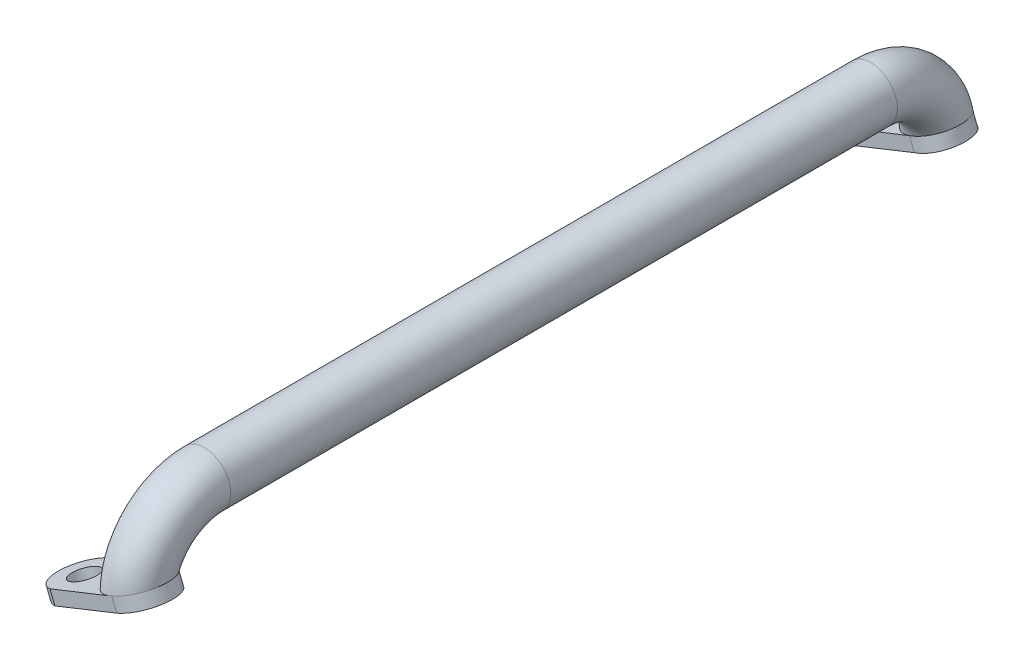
ISO-10303-21;
HEADER;
FILE_DESCRIPTION(('STEP AP214'),'2;1');
FILE_NAME('part.step','',(''),(''),'','','');
FILE_SCHEMA(('AUTOMOTIVE_DESIGN { 1 0 10303 214 1 1 1 1 }'));
ENDSEC;
DATA;
#1=APPLICATION_CONTEXT('core data for automotive mechanical design processes');
#2=APPLICATION_PROTOCOL_DEFINITION('international standard','automotive_design',2000,#1);
#3=PRODUCT_CONTEXT('',#1,'mechanical');
#4=PRODUCT('Part','Part','',(#3));
#5=PRODUCT_RELATED_PRODUCT_CATEGORY('part','',(#4));
#6=PRODUCT_DEFINITION_FORMATION('','',#4);
#7=PRODUCT_DEFINITION_CONTEXT('part definition',#1,'design');
#8=PRODUCT_DEFINITION('design','',#6,#7);
#9=PRODUCT_DEFINITION_SHAPE('','',#8);
#10=(LENGTH_UNIT() NAMED_UNIT(*) SI_UNIT(.MILLI.,.METRE.));
#11=(NAMED_UNIT(*) PLANE_ANGLE_UNIT() SI_UNIT($,.RADIAN.));
#12=(NAMED_UNIT(*) SI_UNIT($,.STERADIAN.) SOLID_ANGLE_UNIT());
#13=UNCERTAINTY_MEASURE_WITH_UNIT(LENGTH_MEASURE(1.E-05),#10,'distance_accuracy_value','');
#14=(GEOMETRIC_REPRESENTATION_CONTEXT(3) GLOBAL_UNCERTAINTY_ASSIGNED_CONTEXT((#13)) GLOBAL_UNIT_ASSIGNED_CONTEXT((#10,
#11,#12)) REPRESENTATION_CONTEXT('',''));
#15=CARTESIAN_POINT('',(0.,0.,0.));
#16=DIRECTION('',(0.,0.,1.));
#17=DIRECTION('',(1.,0.,0.));
#18=AXIS2_PLACEMENT_3D('',#15,#16,#17);
#19=CARTESIAN_POINT('',(-20.43695990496,-4.159248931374,-0.3833355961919));
#20=DIRECTION('',(0.370198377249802,-0.928952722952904,0.));
#21=DIRECTION('',(0.928952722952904,0.370198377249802,0.));
#22=AXIS2_PLACEMENT_3D('',#19,#20,#21);
#23=CYLINDRICAL_SURFACE('',#22,10.58955566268);
#24=DIRECTION('',(0.37019837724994,-0.928952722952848,0.));
#25=VECTOR('',#24,1.);
#26=CARTESIAN_POINT('',(-23.22381807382,-5.269844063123,9.772386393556));
#27=LINE('',#26,#25);
#28=CARTESIAN_POINT('',(-23.2238180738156,-5.26984406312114,9.77238639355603));
#29=VERTEX_POINT('',#28);
#30=CARTESIAN_POINT('',(-21.3728261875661,-9.91460767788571,9.77238639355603));
#31=VERTEX_POINT('',#30);
#32=EDGE_CURVE('E138',#29,#31,#27,.T.);
#33=ORIENTED_EDGE('',*,*,#32,.F.);
#34=CARTESIAN_POINT('',(-20.4369599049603,-4.15924893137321,-0.3833355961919));
#35=DIRECTION('',(0.370198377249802,-0.928952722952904,0.));
#36=DIRECTION('',(0.928952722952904,0.370198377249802,0.));
#37=AXIS2_PLACEMENT_3D('',#34,#35,#36);
#38=CIRCLE('',#37,10.58955566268);
#39=CARTESIAN_POINT('',(-23.2238180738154,-5.26984406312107,-10.53905758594));
#40=VERTEX_POINT('',#39);
#41=EDGE_CURVE('E112',#29,#40,#38,.T.);
#42=ORIENTED_EDGE('',*,*,#41,.T.);
#43=DIRECTION('',(-0.37019837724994,0.928952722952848,0.));
#44=VECTOR('',#43,1.);
#45=CARTESIAN_POINT('',(-21.37282618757,-9.914607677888,-10.53905758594));
#46=LINE('',#45,#44);
#47=CARTESIAN_POINT('',(-21.3728261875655,-9.91460767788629,-10.53905758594));
#48=VERTEX_POINT('',#47);
#49=EDGE_CURVE('E110',#48,#40,#46,.T.);
#50=ORIENTED_EDGE('',*,*,#49,.F.);
#51=CARTESIAN_POINT('',(-18.585968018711,-8.80401254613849,-0.3833355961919));
#52=DIRECTION('',(0.370198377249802,-0.928952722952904,0.));
#53=DIRECTION('',(0.928952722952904,0.370198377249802,0.));
#54=AXIS2_PLACEMENT_3D('',#51,#52,#53);
#55=CIRCLE('',#54,10.58955566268);
#56=EDGE_CURVE('E98',#31,#48,#55,.T.);
#57=ORIENTED_EDGE('',*,*,#56,.F.);
#58=EDGE_LOOP('',(#33,#42,#50,#57));
#59=FACE_BOUND('',#58,.T.);
#60=ADVANCED_FACE('F17',(#59),#23,.T.);
#61=CARTESIAN_POINT('',(-20.43695990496,-4.159248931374,-0.3833355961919));
#62=DIRECTION('',(0.370198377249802,-0.928952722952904,0.));
#63=DIRECTION('',(0.928952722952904,0.370198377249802,0.));
#64=AXIS2_PLACEMENT_3D('',#61,#62,#63);
#65=CYLINDRICAL_SURFACE('',#64,5.);
#66=CARTESIAN_POINT('',(-18.5859680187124,-8.80401254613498,-0.3833355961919));
#67=DIRECTION('',(0.370198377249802,-0.928952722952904,0.));
#68=DIRECTION('',(0.928952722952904,0.370198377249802,0.));
#69=AXIS2_PLACEMENT_3D('',#66,#67,#68);
#70=CIRCLE('',#69,5.);
#71=CARTESIAN_POINT('',(-13.9412044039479,-6.95302065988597,-0.3833355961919));
#72=VERTEX_POINT('',#71);
#73=EDGE_CURVE('E107',#72,#72,#70,.F.);
#74=ORIENTED_EDGE('',*,*,#73,.F.);
#75=EDGE_LOOP('',(#74));
#76=FACE_BOUND('',#75,.T.);
#77=CARTESIAN_POINT('',(-20.43695990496,-4.159248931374,-0.3833355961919));
#78=DIRECTION('',(0.370198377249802,-0.928952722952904,0.));
#79=DIRECTION('',(0.928952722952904,0.370198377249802,0.));
#80=AXIS2_PLACEMENT_3D('',#77,#78,#79);
#81=CIRCLE('',#80,5.);
#82=CARTESIAN_POINT('',(-15.7921962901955,-2.30825704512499,-0.3833355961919));
#83=VERTEX_POINT('',#82);
#84=EDGE_CURVE('E256',#83,#83,#81,.F.);
#85=ORIENTED_EDGE('',*,*,#84,.T.);
#86=EDGE_LOOP('',(#85));
#87=FACE_BOUND('',#86,.T.);
#88=ADVANCED_FACE('F294',(#76,#87),#65,.F.);
#89=CARTESIAN_POINT('',(-20.43695990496,-4.159248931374,-300.3766644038));
#90=DIRECTION('',(-0.370198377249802,0.928952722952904,0.));
#91=DIRECTION('',(-0.928952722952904,-0.370198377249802,0.));
#92=AXIS2_PLACEMENT_3D('',#89,#90,#91);
#93=CYLINDRICAL_SURFACE('',#92,5.);
#94=CARTESIAN_POINT('',(-18.5859680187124,-8.80401254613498,-300.3766644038));
#95=DIRECTION('',(-0.370198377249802,0.928952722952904,0.));
#96=DIRECTION('',(-0.928952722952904,-0.370198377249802,0.));
#97=AXIS2_PLACEMENT_3D('',#94,#95,#96);
#98=CIRCLE('',#97,5.);
#99=CARTESIAN_POINT('',(-23.2307316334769,-10.655004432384,-300.3766644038));
#100=VERTEX_POINT('',#99);
#101=EDGE_CURVE('E248',#100,#100,#98,.F.);
#102=ORIENTED_EDGE('',*,*,#101,.T.);
#103=EDGE_LOOP('',(#102));
#104=FACE_BOUND('',#103,.T.);
#105=CARTESIAN_POINT('',(-20.43695990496,-4.159248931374,-300.3766644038));
#106=DIRECTION('',(-0.370198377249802,0.928952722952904,0.));
#107=DIRECTION('',(-0.928952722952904,-0.370198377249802,0.));
#108=AXIS2_PLACEMENT_3D('',#105,#106,#107);
#109=CIRCLE('',#108,5.);
#110=CARTESIAN_POINT('',(-25.0817235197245,-6.01024081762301,-300.3766644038));
#111=VERTEX_POINT('',#110);
#112=EDGE_CURVE('E250',#111,#111,#109,.F.);
#113=ORIENTED_EDGE('',*,*,#112,.F.);
#114=EDGE_LOOP('',(#113));
#115=FACE_BOUND('',#114,.T.);
#116=ADVANCED_FACE('F291',(#104,#115),#93,.F.);
#117=CARTESIAN_POINT('',(-20.43695990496,-4.159248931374,-300.3766644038));
#118=DIRECTION('',(-0.370198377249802,0.928952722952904,0.));
#119=DIRECTION('',(-0.928952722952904,-0.370198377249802,0.));
#120=AXIS2_PLACEMENT_3D('',#117,#118,#119);
#121=CYLINDRICAL_SURFACE('',#120,10.58955566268);
#122=DIRECTION('',(-0.37019837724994,0.928952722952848,0.));
#123=VECTOR('',#122,1.);
#124=CARTESIAN_POINT('',(-21.37282618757,-9.914607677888,-290.2209424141));
#125=LINE('',#124,#123);
#126=CARTESIAN_POINT('',(-21.3728261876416,-9.91460767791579,-290.2209424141));
#127=VERTEX_POINT('',#126);
#128=CARTESIAN_POINT('',(-23.2238180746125,-5.26984406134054,-290.2209424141));
#129=VERTEX_POINT('',#128);
#130=EDGE_CURVE('E133',#127,#129,#125,.T.);
#131=ORIENTED_EDGE('',*,*,#130,.T.);
#132=CARTESIAN_POINT('',(-20.4369599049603,-4.15924893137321,-300.3766644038));
#133=DIRECTION('',(-0.370198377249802,0.928952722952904,0.));
#134=DIRECTION('',(-0.928952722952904,-0.370198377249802,0.));
#135=AXIS2_PLACEMENT_3D('',#132,#133,#134);
#136=CIRCLE('',#135,10.58955566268);
#137=CARTESIAN_POINT('',(-23.2238180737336,-5.26984406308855,-310.5323863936));
#138=VERTEX_POINT('',#137);
#139=EDGE_CURVE('E260',#138,#129,#136,.T.);
#140=ORIENTED_EDGE('',*,*,#139,.F.);
#141=DIRECTION('',(0.37019837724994,-0.928952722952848,0.));
#142=VECTOR('',#141,1.);
#143=CARTESIAN_POINT('',(-23.22381807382,-5.269844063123,-310.5323863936));
#144=LINE('',#143,#142);
#145=CARTESIAN_POINT('',(-21.3728261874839,-9.91460767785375,-310.5323863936));
#146=VERTEX_POINT('',#145);
#147=EDGE_CURVE('E129',#138,#146,#144,.T.);
#148=ORIENTED_EDGE('',*,*,#147,.T.);
#149=CARTESIAN_POINT('',(-18.585968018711,-8.80401254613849,-300.3766644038));
#150=DIRECTION('',(-0.370198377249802,0.928952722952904,0.));
#151=DIRECTION('',(-0.928952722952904,-0.370198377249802,0.));
#152=AXIS2_PLACEMENT_3D('',#149,#150,#151);
#153=CIRCLE('',#152,10.58955566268);
#154=EDGE_CURVE('E135',#146,#127,#153,.T.);
#155=ORIENTED_EDGE('',*,*,#154,.T.);
#156=EDGE_LOOP('',(#131,#140,#148,#155));
#157=FACE_BOUND('',#156,.T.);
#158=ADVANCED_FACE('F285',(#157),#121,.T.);
#159=CARTESIAN_POINT('',(0.,3.985115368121,9.772386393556));
#160=DIRECTION('',(0.,0.,1.));
#161=DIRECTION('',(1.,0.,0.));
#162=AXIS2_PLACEMENT_3D('',#159,#160,#161);
#163=PLANE('',#162);
#164=DIRECTION('',(0.370198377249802,-0.928952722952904,0.));
#165=VECTOR('',#164,1.);
#166=CARTESIAN_POINT('',(7.2741510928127E-10,3.98511536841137,9.77238639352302));
#167=LINE('',#166,#165);
#168=CARTESIAN_POINT('',(-3.97282995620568E-11,3.98511537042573,9.77238639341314));
#169=VERTEX_POINT('',#168);
#170=CARTESIAN_POINT('',(1.85099188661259,-0.65964824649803,9.77238639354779));
#171=VERTEX_POINT('',#170);
#172=EDGE_CURVE('E224',#169,#171,#167,.T.);
#173=ORIENTED_EDGE('',*,*,#172,.F.);
#174=CARTESIAN_POINT('',(-3.97282994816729E-11,3.98511536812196,9.77238639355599));
#175=CARTESIAN_POINT('',(-0.0388500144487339,3.98513625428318,9.772386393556));
#176=CARTESIAN_POINT('',(-0.0776875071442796,3.98312774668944,9.772386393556));
#177=CARTESIAN_POINT('',(-0.154916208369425,3.9752142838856,9.772386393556));
#178=CARTESIAN_POINT('',(-0.193307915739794,3.96931422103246,9.772386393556));
#179=CARTESIAN_POINT('',(-0.268235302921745,3.95400156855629,9.772386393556));
#180=CARTESIAN_POINT('',(-0.304792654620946,3.94469434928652,9.772386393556));
#181=CARTESIAN_POINT('',(-0.376907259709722,3.92281724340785,9.772386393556));
#182=CARTESIAN_POINT('',(-0.412464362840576,3.91024686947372,9.772386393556));
#183=CARTESIAN_POINT('',(-0.52254553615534,3.86595961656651,9.772386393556));
#184=CARTESIAN_POINT('',(-0.5949535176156,3.82882666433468,9.772386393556));
#185=CARTESIAN_POINT('',(-0.699614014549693,3.76450961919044,9.772386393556));
#186=CARTESIAN_POINT('',(-0.734369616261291,3.74118295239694,9.772386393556));
#187=CARTESIAN_POINT('',(-0.80203071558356,3.69212082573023,9.772386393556));
#188=CARTESIAN_POINT('',(-0.83493993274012,3.66639050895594,9.772386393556));
#189=CARTESIAN_POINT('',(-0.866986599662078,3.63961120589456,9.772386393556));
#190=B_SPLINE_CURVE_WITH_KNOTS('',3,(#174,#175,#176,#177,#178,#179,#180,#181,#182,#183,#184,
#185,#186,#187,#188,#189),.UNSPECIFIED.,.F.,.F.,(4,2,2,2,2,2,2,4),(0.,0.116478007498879,
0.232809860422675,0.345812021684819,0.45883106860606,0.70156768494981,0.827062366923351,
0.952294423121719),.UNSPECIFIED.);
#191=CARTESIAN_POINT('',(-0.866986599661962,3.63961120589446,9.77238639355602));
#192=VERTEX_POINT('',#191);
#193=EDGE_CURVE('E128',#169,#192,#190,.T.);
#194=ORIENTED_EDGE('',*,*,#193,.T.);
#195=DIRECTION('',(0.928952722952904,0.370198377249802,0.));
#196=VECTOR('',#195,1.);
#197=CARTESIAN_POINT('',(-1.370468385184,3.438967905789,9.77238639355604));
#198=LINE('',#197,#196);
#199=EDGE_CURVE('E115',#192,#29,#198,.F.);
#200=ORIENTED_EDGE('',*,*,#199,.T.);
#201=ORIENTED_EDGE('',*,*,#32,.T.);
#202=DIRECTION('',(0.928952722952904,0.370198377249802,0.));
#203=VECTOR('',#202,1.);
#204=CARTESIAN_POINT('',(0.4805235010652,-1.205795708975,9.77238639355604));
#205=LINE('',#204,#203);
#206=EDGE_CURVE('E105',#171,#31,#205,.F.);
#207=ORIENTED_EDGE('',*,*,#206,.F.);
#208=EDGE_LOOP('',(#173,#194,#200,#201,#207));
#209=FACE_BOUND('',#208,.T.);
#210=ADVANCED_FACE('F280',(#209),#163,.T.);
#211=CARTESIAN_POINT('',(0.4805235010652,-1.205795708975,-150.38));
#212=DIRECTION('',(0.370198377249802,-0.928952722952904,0.));
#213=DIRECTION('',(0.928952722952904,0.370198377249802,0.));
#214=AXIS2_PLACEMENT_3D('',#211,#212,#213);
#215=PLANE('',#214);
#216=ORIENTED_EDGE('',*,*,#73,.T.);
#217=EDGE_LOOP('',(#216));
#218=FACE_BOUND('',#217,.T.);
#219=DIRECTION('',(-0.928952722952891,-0.370198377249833,0.));
#220=VECTOR('',#219,1.);
#221=CARTESIAN_POINT('',(1.850991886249,-0.6596482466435,-10.53905758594));
#222=LINE('',#221,#220);
#223=CARTESIAN_POINT('',(1.85099188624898,-0.65964824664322,-10.5390575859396));
#224=VERTEX_POINT('',#223);
#225=EDGE_CURVE('E103',#224,#48,#222,.T.);
#226=ORIENTED_EDGE('',*,*,#225,.F.);
#227=CARTESIAN_POINT('',(1.85099188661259,-0.659648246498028,9.77238639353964));
#228=CARTESIAN_POINT('',(2.02034721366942,-0.592158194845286,9.76464874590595));
#229=CARTESIAN_POINT('',(2.18951795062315,-0.524741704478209,9.7523545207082));
#230=CARTESIAN_POINT('',(2.52708498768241,-0.390217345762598,9.71878387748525));
#231=CARTESIAN_POINT('',(2.69548130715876,-0.323109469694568,9.69750768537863));
#232=CARTESIAN_POINT('',(3.03109291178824,-0.189364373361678,9.64610518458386));
#233=CARTESIAN_POINT('',(3.19830826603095,-0.122727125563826,9.61597939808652));
#234=CARTESIAN_POINT('',(3.53117504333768,0.00992412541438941,9.5469871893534));
#235=CARTESIAN_POINT('',(3.69682645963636,0.0759381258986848,9.50812072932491));
#236=CARTESIAN_POINT('',(4.02569875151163,0.206997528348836,9.42186166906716));
#237=CARTESIAN_POINT('',(4.18892527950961,0.272045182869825,9.37449410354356));
#238=CARTESIAN_POINT('',(4.51302144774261,0.401201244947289,9.27124981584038));
#239=CARTESIAN_POINT('',(4.673891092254,0.465309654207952,9.21537310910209));
#240=CARTESIAN_POINT('',(5.15238261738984,0.655994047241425,9.03526233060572));
#241=CARTESIAN_POINT('',(5.46603467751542,0.780988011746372,8.8985087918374));
#242=CARTESIAN_POINT('',(6.0380586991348,1.00894618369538,8.61389157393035));
#243=CARTESIAN_POINT('',(6.29816881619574,1.11260306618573,8.47003370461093));
#244=CARTESIAN_POINT('',(6.80636300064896,1.31512431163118,8.15951678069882));
#245=CARTESIAN_POINT('',(7.05444817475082,1.41398911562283,7.99285982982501));
#246=CARTESIAN_POINT('',(7.53693055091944,1.60626390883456,7.63807187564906));
#247=CARTESIAN_POINT('',(7.77132961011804,1.69967463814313,7.4499437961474));
#248=CARTESIAN_POINT('',(8.22489888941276,1.88042722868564,7.05349545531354));
#249=CARTESIAN_POINT('',(8.44406926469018,1.96776915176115,6.84517539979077));
#250=CARTESIAN_POINT('',(8.86902684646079,2.13711965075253,6.40607194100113));
#251=CARTESIAN_POINT('',(9.07453567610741,2.21901729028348,6.17497621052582));
#252=CARTESIAN_POINT('',(9.46675658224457,2.37532184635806,5.69498329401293));
#253=CARTESIAN_POINT('',(9.65346837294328,2.44972864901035,5.44608583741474));
#254=CARTESIAN_POINT('',(10.0067237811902,2.59050500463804,4.93212729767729));
#255=CARTESIAN_POINT('',(10.1732627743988,2.65687271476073,4.66706252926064));
#256=CARTESIAN_POINT('',(10.4847341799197,2.78099766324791,4.12260828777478));
#257=CARTESIAN_POINT('',(10.6296667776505,2.83875497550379,3.8432189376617));
#258=CARTESIAN_POINT('',(10.8961901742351,2.94496762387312,3.27348976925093));
#259=CARTESIAN_POINT('',(11.0178889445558,2.99346598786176,2.98320849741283));
#260=CARTESIAN_POINT('',(11.2376281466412,3.08103459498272,2.3924336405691));
#261=CARTESIAN_POINT('',(11.3356684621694,3.12010479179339,2.09194000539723));
#262=CARTESIAN_POINT('',(11.5070341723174,3.18839600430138,1.48290813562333));
#263=CARTESIAN_POINT('',(11.5803611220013,3.21761763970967,1.17437040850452));
#264=CARTESIAN_POINT('',(11.7014903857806,3.26588904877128,0.551535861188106));
#265=CARTESIAN_POINT('',(11.7492934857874,3.28493913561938,0.237239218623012));
#266=CARTESIAN_POINT('',(11.8173744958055,3.31207020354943,-0.384908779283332));
#267=CARTESIAN_POINT('',(11.8384605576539,3.32047324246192,-0.69265746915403));
#268=CARTESIAN_POINT('',(11.8551973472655,3.32714304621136,-1.30895875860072));
#269=CARTESIAN_POINT('',(11.8508491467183,3.32541023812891,-1.61751132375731));
#270=CARTESIAN_POINT('',(11.8162386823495,3.31161756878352,-2.23290553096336));
#271=CARTESIAN_POINT('',(11.7859799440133,3.29955911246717,-2.53974740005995));
#272=CARTESIAN_POINT('',(11.6990326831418,3.26490962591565,-3.14906865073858));
#273=CARTESIAN_POINT('',(11.64234615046,3.24231938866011,-3.45154835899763));
#274=CARTESIAN_POINT('',(11.5072938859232,3.18849950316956,-4.02883293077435));
#275=CARTESIAN_POINT('',(11.4306806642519,3.15796825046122,-4.30411350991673));
#276=CARTESIAN_POINT('',(11.2544622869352,3.08774319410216,-4.84599772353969));
#277=CARTESIAN_POINT('',(11.1548610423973,3.04805094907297,-5.11260282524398));
#278=CARTESIAN_POINT('',(10.9329011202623,2.95959735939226,-5.63439230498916));
#279=CARTESIAN_POINT('',(10.8105571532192,2.91084187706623,-5.88958393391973));
#280=CARTESIAN_POINT('',(10.5438039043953,2.80453762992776,-6.38628457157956));
#281=CARTESIAN_POINT('',(10.3993970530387,2.74698983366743,-6.62779508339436));
#282=CARTESIAN_POINT('',(10.1742431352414,2.65726339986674,-6.96663492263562));
#283=CARTESIAN_POINT('',(10.1019093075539,2.62843753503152,-7.0705344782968));
#284=CARTESIAN_POINT('',(9.95296684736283,2.56908224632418,-7.27471690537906));
#285=CARTESIAN_POINT('',(9.87635838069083,2.5385528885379,-7.37499991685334));
#286=CARTESIAN_POINT('',(9.64037657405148,2.44451141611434,-7.67010606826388));
#287=CARTESIAN_POINT('',(9.47480522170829,2.37852932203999,-7.85924894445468));
#288=CARTESIAN_POINT('',(9.12863776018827,2.24057759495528,-8.22066284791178));
#289=CARTESIAN_POINT('',(8.94804985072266,2.16861122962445,-8.39294297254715));
#290=CARTESIAN_POINT('',(8.6669015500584,2.0565703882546,-8.63758250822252));
#291=CARTESIAN_POINT('',(8.57146346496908,2.01853721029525,-8.7168400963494));
#292=CARTESIAN_POINT('',(8.37733063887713,1.94117303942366,-8.87058984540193));
#293=CARTESIAN_POINT('',(8.27863592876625,1.90184205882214,-8.9450820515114));
#294=CARTESIAN_POINT('',(7.99131437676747,1.78734110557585,-9.15177616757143));
#295=CARTESIAN_POINT('',(7.79893599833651,1.7106761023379,-9.27798935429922));
#296=CARTESIAN_POINT('',(7.40531145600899,1.55381218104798,-9.51316402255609));
#297=CARTESIAN_POINT('',(7.20406567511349,1.47361341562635,-9.62212624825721));
#298=CARTESIAN_POINT('',(6.89664871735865,1.35110421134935,-9.77238286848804));
#299=CARTESIAN_POINT('',(6.79322370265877,1.30988814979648,-9.82028150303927));
#300=CARTESIAN_POINT('',(6.58469350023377,1.22678645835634,-9.91163382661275));
#301=CARTESIAN_POINT('',(6.4795883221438,1.18490083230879,-9.95508754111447));
#302=CARTESIAN_POINT('',(6.16206002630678,1.05836214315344,-10.0788330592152));
#303=CARTESIAN_POINT('',(5.94739060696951,0.972813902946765,-10.152525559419));
#304=CARTESIAN_POINT('',(5.50113823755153,0.79497718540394,-10.2864687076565));
#305=CARTESIAN_POINT('',(5.26929304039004,0.702584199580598,-10.3457013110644));
#306=CARTESIAN_POINT('',(4.80221372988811,0.516447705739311,-10.4455676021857));
#307=CARTESIAN_POINT('',(4.56697924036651,0.422704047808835,-10.4861992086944));
#308=CARTESIAN_POINT('',(3.85827052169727,0.140275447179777,-10.5811045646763));
#309=CARTESIAN_POINT('',(3.38142641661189,-0.0497524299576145,-10.6084950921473));
#310=CARTESIAN_POINT('',(2.72914986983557,-0.309692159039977,-10.6012668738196));
#311=CARTESIAN_POINT('',(2.55293521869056,-0.379915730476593,-10.5948286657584));
#312=CARTESIAN_POINT('',(2.20136876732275,-0.520019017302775,-10.5733181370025));
#313=CARTESIAN_POINT('',(2.02601591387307,-0.589899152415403,-10.5582658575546));
#314=CARTESIAN_POINT('',(1.8509918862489,-0.659648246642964,-10.5390575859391));
#315=B_SPLINE_CURVE_WITH_KNOTS('',3,(#227,#228,#229,#230,#231,#232,#233,#234,#235,#236,#237,
#238,#239,#240,#241,#242,#243,#244,#245,#246,#247,#248,#249,#250,#251,#252,#253,#254,#255,#256,
#257,#258,#259,#260,#261,#262,#263,#264,#265,#266,#267,#268,#269,#270,#271,#272,#273,#274,#275,
#276,#277,#278,#279,#280,#281,#282,#283,#284,#285,#286,#287,#288,#289,#290,#291,#292,#293,#294,
#295,#296,#297,#298,#299,#300,#301,#302,#303,#304,#305,#306,#307,#308,#309,#310,#311,#312,#313,
#314),.UNSPECIFIED.,.F.,.F.,(4,2,2,2,2,2,2,2,2,2,2,2,2,2,2,2,2,2,2,2,2,2,2,2,2,2,2,2,2,2,2,2,2,
2,2,2,2,2,2,2,2,2,2,4),(0.,0.547351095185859,1.09468842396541,1.64199346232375,2.18930086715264,
2.73502220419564,3.28074255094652,4.37169464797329,5.31505940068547,6.25833716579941,
7.20148663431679,8.14462649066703,9.10323131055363,10.0618507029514,11.0206894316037,
11.9795199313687,12.9337799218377,13.8880446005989,14.842249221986,15.7964244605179,
16.7209888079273,17.6455141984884,18.5699138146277,19.4942438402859,20.355210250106,
21.2160302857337,22.0762954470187,22.9364659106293,23.3258741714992,23.7152673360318,
24.4938235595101,25.2719574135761,25.6611087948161,26.0502564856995,26.7769479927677,
27.5036081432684,27.8671298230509,28.2306494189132,28.957570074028,29.7263381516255,
30.4951922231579,32.0316912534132,32.6009780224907,33.1689456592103),.UNSPECIFIED.);
#316=EDGE_CURVE('E238',#171,#224,#315,.T.);
#317=ORIENTED_EDGE('',*,*,#316,.F.);
#318=ORIENTED_EDGE('',*,*,#206,.T.);
#319=ORIENTED_EDGE('',*,*,#56,.T.);
#320=EDGE_LOOP('',(#226,#317,#318,#319));
#321=FACE_BOUND('',#320,.T.);
#322=ADVANCED_FACE('F100',(#218,#321),#215,.T.);
#323=CARTESIAN_POINT('',(-23.22381807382,-5.269844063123,-10.53905758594));
#324=DIRECTION('',(0.,0.,-1.));
#325=DIRECTION('',(-1.,0.,0.));
#326=AXIS2_PLACEMENT_3D('',#323,#324,#325);
#327=PLANE('',#326);
#328=ORIENTED_EDGE('',*,*,#49,.T.);
#329=DIRECTION('',(0.928952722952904,0.370198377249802,0.));
#330=VECTOR('',#329,1.);
#331=CARTESIAN_POINT('',(-1.370468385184,3.438967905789,-10.5390575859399));
#332=LINE('',#331,#330);
#333=CARTESIAN_POINT('',(-1.88681355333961E-09,3.98511534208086,-10.5390575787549));
#334=VERTEX_POINT('',#333);
#335=EDGE_CURVE('E255',#40,#334,#332,.T.);
#336=ORIENTED_EDGE('',*,*,#335,.T.);
#337=DIRECTION('',(0.370198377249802,-0.928952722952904,0.));
#338=VECTOR('',#337,1.);
#339=CARTESIAN_POINT('',(1.2321792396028E-13,3.98511536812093,-10.5390575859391));
#340=LINE('',#339,#338);
#341=EDGE_CURVE('E119',#224,#334,#340,.F.);
#342=ORIENTED_EDGE('',*,*,#341,.F.);
#343=ORIENTED_EDGE('',*,*,#225,.T.);
#344=EDGE_LOOP('',(#328,#336,#342,#343));
#345=FACE_BOUND('',#344,.T.);
#346=ADVANCED_FACE('F117',(#345),#327,.T.);
#347=CARTESIAN_POINT('',(-1.370468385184,3.438967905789,-150.38));
#348=DIRECTION('',(0.370198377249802,-0.928952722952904,0.));
#349=DIRECTION('',(0.928952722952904,0.370198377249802,0.));
#350=AXIS2_PLACEMENT_3D('',#347,#348,#349);
#351=PLANE('',#350);
#352=ORIENTED_EDGE('',*,*,#84,.F.);
#353=EDGE_LOOP('',(#352));
#354=FACE_BOUND('',#353,.T.);
#355=ORIENTED_EDGE('',*,*,#41,.F.);
#356=ORIENTED_EDGE('',*,*,#199,.F.);
#357=CARTESIAN_POINT('',(-1.11483012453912E-08,3.98511536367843,-10.5390575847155));
#358=CARTESIAN_POINT('',(-0.196521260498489,3.90679937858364,-10.5174659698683));
#359=CARTESIAN_POINT('',(-0.392531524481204,3.82868702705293,-10.4906246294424));
#360=CARTESIAN_POINT('',(-0.783095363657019,3.67304283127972,-10.426731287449));
#361=CARTESIAN_POINT('',(-0.977649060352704,3.59551093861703,-10.3896801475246));
#362=CARTESIAN_POINT('',(-1.36496001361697,3.44116305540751,-10.3056388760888));
#363=CARTESIAN_POINT('',(-1.55771667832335,3.36434730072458,-10.2586455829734));
#364=CARTESIAN_POINT('',(-1.940950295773,3.21162428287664,-10.1549492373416));
#365=CARTESIAN_POINT('',(-2.1314271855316,3.13571704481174,-10.0982459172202));
#366=CARTESIAN_POINT('',(-2.70186127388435,2.90839247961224,-9.91284947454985));
#367=CARTESIAN_POINT('',(-3.07781436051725,2.75857083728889,-9.76952412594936));
#368=CARTESIAN_POINT('',(-3.81525657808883,2.46469160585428,-9.44503795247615));
#369=CARTESIAN_POINT('',(-4.17674814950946,2.3206330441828,-9.26388354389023));
#370=CARTESIAN_POINT('',(-4.83992084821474,2.05635107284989,-8.88769455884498));
#371=CARTESIAN_POINT('',(-5.14363199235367,1.93531867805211,-8.69680733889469));
#372=CARTESIAN_POINT('',(-5.73375013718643,1.70014978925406,-8.28613948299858));
#373=CARTESIAN_POINT('',(-6.02015802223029,1.58601294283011,-8.06636032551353));
#374=CARTESIAN_POINT('',(-6.57116718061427,1.36642943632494,-7.59928345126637));
#375=CARTESIAN_POINT('',(-6.83584846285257,1.26095089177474,-7.35209538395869));
#376=CARTESIAN_POINT('',(-7.34088994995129,1.05968603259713,-6.83045166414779));
#377=CARTESIAN_POINT('',(-7.5812580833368,0.963896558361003,-6.55600495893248));
#378=CARTESIAN_POINT('',(-7.97647593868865,0.806397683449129,-6.05429609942));
#379=CARTESIAN_POINT('',(-8.13756228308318,0.742202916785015,-5.83269833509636));
#380=CARTESIAN_POINT('',(-8.44246987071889,0.620693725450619,-5.37616083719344));
#381=CARTESIAN_POINT('',(-8.58629456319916,0.563377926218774,-5.1412237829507));
#382=CARTESIAN_POINT('',(-8.85518287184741,0.456222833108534,-4.65918955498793));
#383=CARTESIAN_POINT('',(-8.98024548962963,0.406383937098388,-4.41209173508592));
#384=CARTESIAN_POINT('',(-9.21021159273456,0.314739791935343,-3.9072242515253));
#385=CARTESIAN_POINT('',(-9.31511429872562,0.272934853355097,-3.64945417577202));
#386=CARTESIAN_POINT('',(-9.50385160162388,0.19772086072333,-3.12411410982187));
#387=CARTESIAN_POINT('',(-9.58761413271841,0.164340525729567,-2.85651406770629));
#388=CARTESIAN_POINT('',(-9.7326069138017,0.106559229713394,-2.3143197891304));
#389=CARTESIAN_POINT('',(-9.79383706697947,0.0821583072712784,-2.03972552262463));
#390=CARTESIAN_POINT('',(-9.89302132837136,0.0426322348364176,-1.48572306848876));
#391=CARTESIAN_POINT('',(-9.93097706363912,0.0275064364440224,-1.20631521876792));
#392=CARTESIAN_POINT('',(-9.98316029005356,0.00671081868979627,-0.644948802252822));
#393=CARTESIAN_POINT('',(-9.99738896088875,0.00104052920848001,-0.362990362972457));
#394=CARTESIAN_POINT('',(-10.0018121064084,-0.000722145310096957,0.183349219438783));
#395=CARTESIAN_POINT('',(-9.99346509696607,0.00260423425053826,0.447717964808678));
#396=CARTESIAN_POINT('',(-9.9558871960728,0.0175794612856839,0.97472072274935));
#397=CARTESIAN_POINT('',(-9.92665728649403,0.0292279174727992,1.23735481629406));
#398=CARTESIAN_POINT('',(-9.84760874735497,0.0607296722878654,1.75896714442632));
#399=CARTESIAN_POINT('',(-9.79779285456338,0.0805818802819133,2.01794586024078));
#400=CARTESIAN_POINT('',(-9.67804836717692,0.128301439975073,2.53045719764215));
#401=CARTESIAN_POINT('',(-9.60811955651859,0.15616887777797,2.7839897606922));
#402=CARTESIAN_POINT('',(-9.44931508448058,0.219454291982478,3.28222162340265));
#403=CARTESIAN_POINT('',(-9.3605663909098,0.254821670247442,3.52696786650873));
#404=CARTESIAN_POINT('',(-9.16462955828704,0.33290475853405,4.0077432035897));
#405=CARTESIAN_POINT('',(-9.05744162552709,0.375620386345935,4.24377239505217));
#406=CARTESIAN_POINT('',(-8.8255126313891,0.468046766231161,4.70563306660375));
#407=CARTESIAN_POINT('',(-8.7007702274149,0.517758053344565,4.93146376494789));
#408=CARTESIAN_POINT('',(-8.43473266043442,0.623777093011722,5.37153598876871));
#409=CARTESIAN_POINT('',(-8.29343664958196,0.680085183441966,5.58577691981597));
#410=CARTESIAN_POINT('',(-7.99086581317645,0.800663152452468,6.00769496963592));
#411=CARTESIAN_POINT('',(-7.82911576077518,0.865122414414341,6.21497721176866));
#412=CARTESIAN_POINT('',(-7.49046217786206,1.00007977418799,6.61465740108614));
#413=CARTESIAN_POINT('',(-7.31355837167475,1.07057798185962,6.80705507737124));
#414=CARTESIAN_POINT('',(-6.94593991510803,1.21707817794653,7.17585216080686));
#415=CARTESIAN_POINT('',(-6.75522657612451,1.29307964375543,7.35225308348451));
#416=CARTESIAN_POINT('',(-6.36126517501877,1.45007780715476,7.688190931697));
#417=CARTESIAN_POINT('',(-6.15801182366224,1.53107661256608,7.84772066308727));
#418=CARTESIAN_POINT('',(-5.73144234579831,1.7010694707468,8.15550810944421));
#419=CARTESIAN_POINT('',(-5.50763910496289,1.79025764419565,8.30298391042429));
#420=CARTESIAN_POINT('',(-5.04971443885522,1.97274590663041,8.5777707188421));
#421=CARTESIAN_POINT('',(-4.81559682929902,2.06604447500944,8.70508910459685));
#422=CARTESIAN_POINT('',(-4.33852314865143,2.25616384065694,8.93903710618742));
#423=CARTESIAN_POINT('',(-4.09556472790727,2.35298557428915,9.04566117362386));
#424=CARTESIAN_POINT('',(-3.60260862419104,2.54943426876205,9.23767311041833));
#425=CARTESIAN_POINT('',(-3.3526122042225,2.64906072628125,9.32306476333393));
#426=CARTESIAN_POINT('',(-2.73548549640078,2.89499283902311,9.50523742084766));
#427=CARTESIAN_POINT('',(-2.36532099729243,3.04250766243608,9.59043267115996));
#428=CARTESIAN_POINT('',(-1.8057846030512,3.26548937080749,9.68413737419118));
#429=CARTESIAN_POINT('',(-1.61871331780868,3.34003943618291,9.70968386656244));
#430=CARTESIAN_POINT('',(-1.24351379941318,3.48956077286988,9.74949409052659));
#431=CARTESIAN_POINT('',(-1.05538543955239,3.56453209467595,9.76375643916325));
#432=CARTESIAN_POINT('',(-0.866986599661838,3.63961120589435,9.77238639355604));
#433=B_SPLINE_CURVE_WITH_KNOTS('',3,(#357,#358,#359,#360,#361,#362,#363,#364,#365,#366,#367,
#368,#369,#370,#371,#372,#373,#374,#375,#376,#377,#378,#379,#380,#381,#382,#383,#384,#385,#386,
#387,#388,#389,#390,#391,#392,#393,#394,#395,#396,#397,#398,#399,#400,#401,#402,#403,#404,#405,
#406,#407,#408,#409,#410,#411,#412,#413,#414,#415,#416,#417,#418,#419,#420,#421,#422,#423,#424,
#425,#426,#427,#428,#429,#430,#431,#432),.UNSPECIFIED.,.F.,.F.,(4,2,2,2,2,2,2,2,2,2,2,2,2,2,2,2,
2,2,2,2,2,2,2,2,2,2,2,2,2,2,2,2,2,2,2,2,2,4),(0.,0.637863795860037,1.27567377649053,
1.91368688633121,2.55171758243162,3.83764882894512,5.12336214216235,6.25765430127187,
7.39188843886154,8.52173848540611,9.65121889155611,10.4945098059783,11.3376319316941,
12.1807989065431,13.0239984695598,13.8700347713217,14.7160747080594,15.5620554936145,
16.4079942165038,17.2006070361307,17.9931825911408,18.7856528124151,19.5781315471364,
20.3654248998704,21.1527094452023,21.9400542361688,22.7274393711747,23.5386540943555,
24.3498835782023,25.1610361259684,25.9725331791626,26.8189975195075,27.6651513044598,
28.5115316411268,29.3577610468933,30.5771962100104,31.185912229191,31.7947028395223),.UNSPECIFIED.);
#434=EDGE_CURVE('E237',#334,#192,#433,.T.);
#435=ORIENTED_EDGE('',*,*,#434,.F.);
#436=ORIENTED_EDGE('',*,*,#335,.F.);
#437=EDGE_LOOP('',(#355,#356,#435,#436));
#438=FACE_BOUND('',#437,.T.);
#439=ADVANCED_FACE('F393',(#354,#438),#351,.F.);
#440=CARTESIAN_POINT('',(-1.370468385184,3.438967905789,-150.38));
#441=DIRECTION('',(-0.370198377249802,0.928952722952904,0.));
#442=DIRECTION('',(-0.928952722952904,-0.370198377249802,0.));
#443=AXIS2_PLACEMENT_3D('',#440,#441,#442);
#444=PLANE('',#443);
#445=ORIENTED_EDGE('',*,*,#112,.T.);
#446=EDGE_LOOP('',(#445));
#447=FACE_BOUND('',#446,.T.);
#448=DIRECTION('',(0.928952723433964,0.370198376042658,0.));
#449=VECTOR('',#448,1.);
#450=CARTESIAN_POINT('',(-23.22381807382,-5.269844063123,-290.2209424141));
#451=LINE('',#450,#449);
#452=CARTESIAN_POINT('',(-1.98075643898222E-09,3.98511533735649,-290.220942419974));
#453=VERTEX_POINT('',#452);
#454=EDGE_CURVE('E136',#129,#453,#451,.T.);
#455=ORIENTED_EDGE('',*,*,#454,.T.);
#456=CARTESIAN_POINT('',(-0.866986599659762,3.63961120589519,-310.532386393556));
#457=CARTESIAN_POINT('',(-1.14514685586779,3.52876113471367,-310.51967736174));
#458=CARTESIAN_POINT('',(-1.42283301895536,3.41809999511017,-310.494621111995));
#459=CARTESIAN_POINT('',(-1.9753701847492,3.19790756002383,-310.419901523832));
#460=CARTESIAN_POINT('',(-2.25022079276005,3.08837642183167,-310.370234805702));
#461=CARTESIAN_POINT('',(-2.79540922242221,2.8711125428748,-310.246319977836));
#462=CARTESIAN_POINT('',(-3.06574198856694,2.76338181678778,-310.172046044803));
#463=CARTESIAN_POINT('',(-3.59961919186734,2.55062559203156,-309.999235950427));
#464=CARTESIAN_POINT('',(-3.86316402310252,2.44559993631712,-309.900701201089));
#465=CARTESIAN_POINT('',(-4.38188351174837,2.23888423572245,-309.67967036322));
#466=CARTESIAN_POINT('',(-4.63704554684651,2.13719922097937,-309.557139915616));
#467=CARTESIAN_POINT('',(-5.13661447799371,1.9381152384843,-309.288859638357));
#468=CARTESIAN_POINT('',(-5.38102148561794,1.8407162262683,-309.143110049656));
#469=CARTESIAN_POINT('',(-5.85694838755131,1.65105386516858,-308.829338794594));
#470=CARTESIAN_POINT('',(-6.0884769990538,1.55878704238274,-308.661332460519));
#471=CARTESIAN_POINT('',(-6.53688166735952,1.38009260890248,-308.304010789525));
#472=CARTESIAN_POINT('',(-6.75375828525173,1.29366477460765,-308.114696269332));
#473=CARTESIAN_POINT('',(-7.16443336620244,1.13000601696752,-307.722245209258));
#474=CARTESIAN_POINT('',(-7.35874178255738,1.05257187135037,-307.519726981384));
#475=CARTESIAN_POINT('',(-7.73016718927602,0.904554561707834,-307.09718253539));
#476=CARTESIAN_POINT('',(-7.90728502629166,0.83397106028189,-306.877157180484));
#477=CARTESIAN_POINT('',(-8.242763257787,0.700279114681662,-306.421079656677));
#478=CARTESIAN_POINT('',(-8.40112219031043,0.63717125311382,-306.185026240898));
#479=CARTESIAN_POINT('',(-8.69757696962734,0.519030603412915,-305.698606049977));
#480=CARTESIAN_POINT('',(-8.83567361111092,0.46399749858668,-305.44823983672));
#481=CARTESIAN_POINT('',(-9.08440645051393,0.364874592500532,-304.946855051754));
#482=CARTESIAN_POINT('',(-9.19601168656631,0.320398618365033,-304.696393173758));
#483=CARTESIAN_POINT('',(-9.39849334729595,0.239707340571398,-304.185950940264));
#484=CARTESIAN_POINT('',(-9.4893712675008,0.203491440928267,-303.925971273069));
#485=CARTESIAN_POINT('',(-9.64949091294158,0.139681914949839,-303.398484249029));
#486=CARTESIAN_POINT('',(-9.71873909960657,0.112085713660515,-303.130979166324));
#487=CARTESIAN_POINT('',(-9.83492709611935,0.0657834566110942,-302.590411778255));
#488=CARTESIAN_POINT('',(-9.88186753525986,0.0470771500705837,-302.317349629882));
#489=CARTESIAN_POINT('',(-9.95148876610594,0.0193322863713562,-301.779060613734));
#490=CARTESIAN_POINT('',(-9.97508365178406,0.00992945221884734,-301.513970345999));
#491=CARTESIAN_POINT('',(-10.0010602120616,-0.000422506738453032,-300.982592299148));
#492=CARTESIAN_POINT('',(-10.0034425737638,-0.00137190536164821,-300.7163045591));
#493=CARTESIAN_POINT('',(-9.9869710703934,0.00519217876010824,-300.1845326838));
#494=CARTESIAN_POINT('',(-9.96812034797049,0.0127044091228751,-299.919048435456));
#495=CARTESIAN_POINT('',(-9.9093871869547,0.0361102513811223,-299.390792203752));
#496=CARTESIAN_POINT('',(-9.86950482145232,0.0520038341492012,-299.12802021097));
#497=CARTESIAN_POINT('',(-9.76998519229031,0.0916635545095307,-298.611485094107));
#498=CARTESIAN_POINT('',(-9.71069292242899,0.115292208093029,-298.357644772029));
#499=CARTESIAN_POINT('',(-9.57281251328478,0.170239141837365,-297.856123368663));
#500=CARTESIAN_POINT('',(-9.49422474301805,0.201557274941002,-297.608442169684));
#501=CARTESIAN_POINT('',(-9.31856044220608,0.27156152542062,-297.120807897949));
#502=CARTESIAN_POINT('',(-9.2214838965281,0.310247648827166,-296.880854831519));
#503=CARTESIAN_POINT('',(-9.00981699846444,0.394599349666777,-296.410080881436));
#504=CARTESIAN_POINT('',(-8.89522616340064,0.440265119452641,-296.179260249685));
#505=CARTESIAN_POINT('',(-8.64556461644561,0.539758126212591,-295.720481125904));
#506=CARTESIAN_POINT('',(-8.50994037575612,0.593805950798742,-295.492871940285));
#507=CARTESIAN_POINT('',(-8.22252159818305,0.708345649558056,-295.049829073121));
#508=CARTESIAN_POINT('',(-8.07072684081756,0.768837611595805,-294.83439555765));
#509=CARTESIAN_POINT('',(-7.7523845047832,0.895700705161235,-294.416606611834));
#510=CARTESIAN_POINT('',(-7.58583825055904,0.962071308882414,-294.214250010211));
#511=CARTESIAN_POINT('',(-7.23933500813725,1.10015684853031,-293.823177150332));
#512=CARTESIAN_POINT('',(-7.05937229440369,1.17187406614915,-293.63446678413));
#513=CARTESIAN_POINT('',(-6.66833751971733,1.32770593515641,-293.252533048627));
#514=CARTESIAN_POINT('',(-6.45597027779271,1.41233673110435,-293.06084604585));
#515=CARTESIAN_POINT('',(-6.01848404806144,1.58668004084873,-292.695136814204));
#516=CARTESIAN_POINT('',(-5.79336341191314,1.67639321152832,-292.521116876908));
#517=CARTESIAN_POINT('',(-5.33177514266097,1.86034146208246,-292.190780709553));
#518=CARTESIAN_POINT('',(-5.09529325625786,1.9545822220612,-292.034487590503));
#519=CARTESIAN_POINT('',(-4.61279333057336,2.14686400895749,-291.739994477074));
#520=CARTESIAN_POINT('',(-4.36677409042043,2.2449055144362,-291.601796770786));
#521=CARTESIAN_POINT('',(-3.7933204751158,2.47343339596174,-291.305787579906));
#522=CARTESIAN_POINT('',(-3.46314741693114,2.60501116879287,-291.154088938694));
#523=CARTESIAN_POINT('',(-2.79196397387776,2.87248551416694,-290.881535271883));
#524=CARTESIAN_POINT('',(-2.45095121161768,3.00838303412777,-290.760687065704));
#525=CARTESIAN_POINT('',(-1.76139788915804,3.28317798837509,-290.550842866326));
#526=CARTESIAN_POINT('',(-1.41287756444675,3.42206735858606,-290.461770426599));
#527=CARTESIAN_POINT('',(-0.885843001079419,3.6320967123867,-290.352723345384));
#528=CARTESIAN_POINT('',(-0.709457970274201,3.70238818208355,-290.320468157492));
#529=CARTESIAN_POINT('',(-0.35552808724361,3.84343332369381,-290.264353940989));
#530=CARTESIAN_POINT('',(-0.17798315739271,3.9141870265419,-290.240495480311));
#531=CARTESIAN_POINT('',(-1.27172548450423E-08,3.98511536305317,-290.220942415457));
#532=B_SPLINE_CURVE_WITH_KNOTS('',3,(#456,#457,#458,#459,#460,#461,#462,#463,#464,#465,#466,
#467,#468,#469,#470,#471,#472,#473,#474,#475,#476,#477,#478,#479,#480,#481,#482,#483,#484,#485,
#486,#487,#488,#489,#490,#491,#492,#493,#494,#495,#496,#497,#498,#499,#500,#501,#502,#503,#504,
#505,#506,#507,#508,#509,#510,#511,#512,#513,#514,#515,#516,#517,#518,#519,#520,#521,#522,#523,
#524,#525,#526,#527,#528,#529,#530,#531),.UNSPECIFIED.,.F.,.F.,(4,2,2,2,2,2,2,2,2,2,2,2,2,2,2,2,
2,2,2,2,2,2,2,2,2,2,2,2,2,2,2,2,2,2,2,2,2,4),(0.,0.898880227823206,1.79788393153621,
2.69783407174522,3.5977318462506,4.49892771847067,5.40011423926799,6.3006831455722,
7.20121754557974,8.07355773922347,8.94585494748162,9.81822009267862,10.6905510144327,
11.5228686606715,12.3551262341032,13.1871349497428,14.0191201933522,14.8170610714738,
15.6149761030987,16.4127730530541,17.2105672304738,17.9948883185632,18.7791944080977,
19.5635011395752,20.3478294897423,21.158191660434,21.968564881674,22.778865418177,
23.5895137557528,24.4836394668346,25.3778810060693,26.2732753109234,27.1687827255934,
28.3266088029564,29.4846905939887,30.6399671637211,31.2175914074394,31.7952547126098),.UNSPECIFIED.);
#533=CARTESIAN_POINT('',(-0.866986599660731,3.6396112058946,-310.532386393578));
#534=VERTEX_POINT('',#533);
#535=EDGE_CURVE('E152',#534,#453,#532,.T.);
#536=ORIENTED_EDGE('',*,*,#535,.F.);
#537=DIRECTION('',(-0.928952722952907,-0.370198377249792,0.));
#538=VECTOR('',#537,1.);
#539=CARTESIAN_POINT('',(-0.8669865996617,3.639611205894,-310.5323863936));
#540=LINE('',#539,#538);
#541=EDGE_CURVE('E132',#534,#138,#540,.T.);
#542=ORIENTED_EDGE('',*,*,#541,.T.);
#543=ORIENTED_EDGE('',*,*,#139,.T.);
#544=EDGE_LOOP('',(#455,#536,#542,#543));
#545=FACE_BOUND('',#544,.T.);
#546=ADVANCED_FACE('F397',(#447,#545),#444,.T.);
#547=CARTESIAN_POINT('',(-23.22381807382,-5.269844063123,-290.2209424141));
#548=DIRECTION('',(0.,0.,-1.));
#549=DIRECTION('',(-1.,0.,0.));
#550=AXIS2_PLACEMENT_3D('',#547,#548,#549);
#551=PLANE('',#550);
#552=DIRECTION('',(-0.928952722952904,-0.370198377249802,0.));
#553=VECTOR('',#552,1.);
#554=CARTESIAN_POINT('',(0.4805235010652,-1.205795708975,-290.2209424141));
#555=LINE('',#554,#553);
#556=CARTESIAN_POINT('',(1.85099187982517,-0.659648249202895,-290.220942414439));
#557=VERTEX_POINT('',#556);
#558=EDGE_CURVE('E246',#127,#557,#555,.F.);
#559=ORIENTED_EDGE('',*,*,#558,.T.);
#560=DIRECTION('',(-0.370198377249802,0.928952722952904,0.));
#561=VECTOR('',#560,1.);
#562=CARTESIAN_POINT('',(-1.28472176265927E-08,3.98511536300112,-290.220942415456));
#563=LINE('',#562,#561);
#564=EDGE_CURVE('E151',#453,#557,#563,.F.);
#565=ORIENTED_EDGE('',*,*,#564,.F.);
#566=ORIENTED_EDGE('',*,*,#454,.F.);
#567=ORIENTED_EDGE('',*,*,#130,.F.);
#568=EDGE_LOOP('',(#559,#565,#566,#567));
#569=FACE_BOUND('',#568,.T.);
#570=ADVANCED_FACE('F465',(#569),#551,.F.);
#571=CARTESIAN_POINT('',(0.4805235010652,-1.205795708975,-150.38));
#572=DIRECTION('',(-0.370198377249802,0.928952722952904,0.));
#573=DIRECTION('',(-0.928952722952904,-0.370198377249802,0.));
#574=AXIS2_PLACEMENT_3D('',#571,#572,#573);
#575=PLANE('',#574);
#576=ORIENTED_EDGE('',*,*,#101,.F.);
#577=EDGE_LOOP('',(#576));
#578=FACE_BOUND('',#577,.T.);
#579=ORIENTED_EDGE('',*,*,#154,.F.);
#580=DIRECTION('',(0.928952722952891,0.370198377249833,0.));
#581=VECTOR('',#580,1.);
#582=CARTESIAN_POINT('',(-21.37282618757,-9.914607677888,-310.5323863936));
#583=LINE('',#582,#581);
#584=CARTESIAN_POINT('',(1.85099188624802,-0.659648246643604,-310.532386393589));
#585=VERTEX_POINT('',#584);
#586=EDGE_CURVE('E131',#146,#585,#583,.T.);
#587=ORIENTED_EDGE('',*,*,#586,.T.);
#588=CARTESIAN_POINT('',(1.85099187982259,-0.659648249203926,-290.220942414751));
#589=CARTESIAN_POINT('',(2.07390687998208,-0.570814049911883,-290.196471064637));
#590=CARTESIAN_POINT('',(2.29749597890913,-0.481711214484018,-290.178746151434));
#591=CARTESIAN_POINT('',(2.74579629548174,-0.303058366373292,-290.15739331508));
#592=CARTESIAN_POINT('',(2.97050892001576,-0.213507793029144,-290.153799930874));
#593=CARTESIAN_POINT('',(3.41992115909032,-0.0344118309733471,-290.161443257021));
#594=CARTESIAN_POINT('',(3.64462060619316,0.0551334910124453,-290.172692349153));
#595=CARTESIAN_POINT('',(4.09405506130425,0.234238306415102,-290.210836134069));
#596=CARTESIAN_POINT('',(4.31878424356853,0.32379547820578,-290.237811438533));
#597=CARTESIAN_POINT('',(4.76586282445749,0.50196145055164,-290.308108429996));
#598=CARTESIAN_POINT('',(4.98821394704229,0.590570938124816,-290.351417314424));
#599=CARTESIAN_POINT('',(5.42937375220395,0.766378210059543,-290.454872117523));
#600=CARTESIAN_POINT('',(5.6481846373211,0.853576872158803,-290.515007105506));
#601=CARTESIAN_POINT('',(6.08974540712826,1.02954393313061,-290.655394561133));
#602=CARTESIAN_POINT('',(6.31230201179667,1.11823530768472,-290.736356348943));
#603=CARTESIAN_POINT('',(6.75053387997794,1.29287576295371,-290.917593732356));
#604=CARTESIAN_POINT('',(6.96620944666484,1.37882496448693,-291.01786847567));
#605=CARTESIAN_POINT('',(7.3883416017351,1.54704949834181,-291.237096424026));
#606=CARTESIAN_POINT('',(7.59482587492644,1.62933586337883,-291.355987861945));
#607=CARTESIAN_POINT('',(7.99768875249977,1.78988136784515,-291.612275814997));
#608=CARTESIAN_POINT('',(8.19406757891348,1.86814059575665,-291.749671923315));
#609=CARTESIAN_POINT('',(8.47996817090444,1.98207528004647,-291.969548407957));
#610=CARTESIAN_POINT('',(8.57400350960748,2.01954944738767,-292.045303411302));
#611=CARTESIAN_POINT('',(8.7588591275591,2.09321654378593,-292.201230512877));
#612=CARTESIAN_POINT('',(8.84967938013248,2.12940946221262,-292.28140264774));
#613=CARTESIAN_POINT('',(9.11708460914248,2.235973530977,-292.528257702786));
#614=CARTESIAN_POINT('',(9.288654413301,2.30434607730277,-292.701310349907));
#615=CARTESIAN_POINT('',(9.61724444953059,2.43529299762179,-293.063056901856));
#616=CARTESIAN_POINT('',(9.77424908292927,2.49786115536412,-293.25176717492));
#617=CARTESIAN_POINT('',(10.0722344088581,2.61661174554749,-293.643318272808));
#618=CARTESIAN_POINT('',(10.2132156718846,2.6727944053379,-293.846158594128));
#619=CARTESIAN_POINT('',(10.4729142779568,2.77628729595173,-294.255402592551));
#620=CARTESIAN_POINT('',(10.5923145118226,2.82386966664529,-294.461305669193));
#621=CARTESIAN_POINT('',(10.8153275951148,2.91274295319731,-294.88277820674));
#622=CARTESIAN_POINT('',(10.9189409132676,2.95403405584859,-295.098347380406));
#623=CARTESIAN_POINT('',(11.1098888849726,3.0301290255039,-295.537627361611));
#624=CARTESIAN_POINT('',(11.1972265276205,3.06493408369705,-295.761336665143));
#625=CARTESIAN_POINT('',(11.3554955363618,3.1280061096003,-296.215376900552));
#626=CARTESIAN_POINT('',(11.4264261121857,3.15627276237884,-296.445708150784));
#627=CARTESIAN_POINT('',(11.5557150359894,3.20779589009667,-296.925632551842));
#628=CARTESIAN_POINT('',(11.6130480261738,3.23064374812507,-297.175545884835));
#629=CARTESIAN_POINT('',(11.7092642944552,3.26898704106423,-297.679447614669));
#630=CARTESIAN_POINT('',(11.7481471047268,3.28448228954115,-297.933436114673));
#631=CARTESIAN_POINT('',(11.8076095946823,3.30817877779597,-298.443955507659));
#632=CARTESIAN_POINT('',(11.8281834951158,3.31637771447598,-298.700487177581));
#633=CARTESIAN_POINT('',(11.8513278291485,3.32560099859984,-299.214485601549));
#634=CARTESIAN_POINT('',(11.8538974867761,3.32662503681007,-299.471952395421));
#635=CARTESIAN_POINT('',(11.8407431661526,3.3213828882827,-300.009530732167));
#636=CARTESIAN_POINT('',(11.8233529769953,3.31445269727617,-300.2895961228));
#637=CARTESIAN_POINT('',(11.7679406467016,3.29237024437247,-300.847349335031));
#638=CARTESIAN_POINT('',(11.7299174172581,3.27721754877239,-301.125037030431));
#639=CARTESIAN_POINT('',(11.6338588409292,3.23893709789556,-301.676430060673));
#640=CARTESIAN_POINT('',(11.5758189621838,3.21580753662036,-301.950134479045));
#641=CARTESIAN_POINT('',(11.4403107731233,3.16180595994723,-302.491915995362));
#642=CARTESIAN_POINT('',(11.3628415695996,3.13093358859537,-302.75999283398));
#643=CARTESIAN_POINT('',(11.1826759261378,3.05913550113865,-303.308490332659));
#644=CARTESIAN_POINT('',(11.0785408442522,3.01763646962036,-303.588364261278));
#645=CARTESIAN_POINT('',(10.8495725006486,2.92638994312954,-304.138123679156));
#646=CARTESIAN_POINT('',(10.7247382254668,2.87664204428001,-304.40800867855));
#647=CARTESIAN_POINT('',(10.4552878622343,2.76926296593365,-304.936146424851));
#648=CARTESIAN_POINT('',(10.3106682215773,2.71163037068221,-305.194397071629));
#649=CARTESIAN_POINT('',(10.0026515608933,2.58888217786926,-305.697574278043));
#650=CARTESIAN_POINT('',(9.83925425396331,2.52376646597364,-305.942500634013));
#651=CARTESIAN_POINT('',(9.48723483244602,2.38348266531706,-306.428163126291));
#652=CARTESIAN_POINT('',(9.29781435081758,2.30799641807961,-306.668229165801));
#653=CARTESIAN_POINT('',(8.90111706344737,2.14990797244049,-307.130620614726));
#654=CARTESIAN_POINT('',(8.69383969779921,2.06730555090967,-307.35294546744));
#655=CARTESIAN_POINT('',(8.26279008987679,1.89552730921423,-307.778339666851));
#656=CARTESIAN_POINT('',(8.03901376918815,1.80634986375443,-307.981404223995));
#657=CARTESIAN_POINT('',(7.57665579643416,1.62209487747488,-308.366948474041));
#658=CARTESIAN_POINT('',(7.33807428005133,1.52701739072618,-308.549428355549));
#659=CARTESIAN_POINT('',(6.84355017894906,1.32994383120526,-308.895350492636));
#660=CARTESIAN_POINT('',(6.58738328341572,1.22785836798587,-309.05842146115));
#661=CARTESIAN_POINT('',(6.06311555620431,1.01893163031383,-309.360634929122));
#662=CARTESIAN_POINT('',(5.79501368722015,0.912089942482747,-309.499775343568));
#663=CARTESIAN_POINT('',(5.24904982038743,0.694517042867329,-309.753025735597));
#664=CARTESIAN_POINT('',(4.97119560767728,0.583788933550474,-309.867155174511));
#665=CARTESIAN_POINT('',(4.40749527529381,0.359147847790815,-310.069422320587));
#666=CARTESIAN_POINT('',(4.12165174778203,0.245235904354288,-310.157568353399));
#667=CARTESIAN_POINT('',(3.67033956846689,0.0653827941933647,-310.274503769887));
#668=CARTESIAN_POINT('',(3.50685811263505,0.000233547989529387,-310.312398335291));
#669=CARTESIAN_POINT('',(3.17842008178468,-0.130652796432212,-310.379677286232));
#670=CARTESIAN_POINT('',(3.01346387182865,-0.196389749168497,-310.409063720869));
#671=CARTESIAN_POINT('',(2.68267492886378,-0.328212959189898,-310.459185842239));
#672=CARTESIAN_POINT('',(2.51684388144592,-0.39429854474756,-310.479934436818));
#673=CARTESIAN_POINT('',(2.1843993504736,-0.526781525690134,-310.51272528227));
#674=CARTESIAN_POINT('',(2.01778568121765,-0.593178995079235,-310.524765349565));
#675=CARTESIAN_POINT('',(1.85099188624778,-0.659648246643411,-310.532386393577));
#676=B_SPLINE_CURVE_WITH_KNOTS('',3,(#588,#589,#590,#591,#592,#593,#594,#595,#596,#597,#598,
#599,#600,#601,#602,#603,#604,#605,#606,#607,#608,#609,#610,#611,#612,#613,#614,#615,#616,#617,
#618,#619,#620,#621,#622,#623,#624,#625,#626,#627,#628,#629,#630,#631,#632,#633,#634,#635,#636,
#637,#638,#639,#640,#641,#642,#643,#644,#645,#646,#647,#648,#649,#650,#651,#652,#653,#654,#655,
#656,#657,#658,#659,#660,#661,#662,#663,#664,#665,#666,#667,#668,#669,#670,#671,#672,#673,#674,
#675),.UNSPECIFIED.,.F.,.F.,(4,2,2,2,2,2,2,2,2,2,2,2,2,2,2,2,2,2,2,2,2,2,2,2,2,2,2,2,2,2,2,2,2,
2,2,2,2,2,2,2,2,2,2,4),(0.,0.723585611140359,1.44893864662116,2.17489716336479,2.90461003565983,
3.63375212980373,4.36242164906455,5.1202778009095,5.87810051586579,6.63346019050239,
7.38880326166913,7.76799817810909,8.14719623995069,8.90543268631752,9.66447201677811,
10.4234843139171,11.1508720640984,11.8782382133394,12.6054706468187,13.3327381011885,
14.1041809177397,14.8756432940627,15.647349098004,16.4190881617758,17.260241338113,
18.1014388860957,18.9428270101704,19.784253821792,20.6877049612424,21.591200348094,
22.4948581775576,23.3985298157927,24.3423667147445,25.2862332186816,26.2303338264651,
27.1744257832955,28.1343766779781,29.0944111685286,30.053695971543,31.012673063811,
31.5525492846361,32.09229537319,32.6312319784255,33.170303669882),.UNSPECIFIED.);
#677=EDGE_CURVE('E141',#557,#585,#676,.T.);
#678=ORIENTED_EDGE('',*,*,#677,.F.);
#679=ORIENTED_EDGE('',*,*,#558,.F.);
#680=EDGE_LOOP('',(#579,#587,#678,#679));
#681=FACE_BOUND('',#680,.T.);
#682=ADVANCED_FACE('F154',(#578,#681),#575,.F.);
#683=CARTESIAN_POINT('',(0.,3.985115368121,-310.5323863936));
#684=DIRECTION('',(0.,0.,1.));
#685=DIRECTION('',(1.,0.,0.));
#686=AXIS2_PLACEMENT_3D('',#683,#684,#685);
#687=PLANE('',#686);
#688=ORIENTED_EDGE('',*,*,#586,.F.);
#689=ORIENTED_EDGE('',*,*,#147,.F.);
#690=ORIENTED_EDGE('',*,*,#541,.F.);
#691=CARTESIAN_POINT('',(-2.18669526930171E-11,3.98511536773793,-310.5323863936));
#692=CARTESIAN_POINT('',(-0.0388500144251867,3.9851362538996,-310.5323863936));
#693=CARTESIAN_POINT('',(-0.0776875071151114,3.98312774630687,-310.5323863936));
#694=CARTESIAN_POINT('',(-0.154916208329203,3.97521428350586,-310.5323863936));
#695=CARTESIAN_POINT('',(-0.193307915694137,3.96931422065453,-310.5323863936));
#696=CARTESIAN_POINT('',(-0.268235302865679,3.95400156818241,-310.5323863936));
#697=CARTESIAN_POINT('',(-0.304792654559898,3.94469434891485,-310.5323863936));
#698=CARTESIAN_POINT('',(-0.376907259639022,3.9228172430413,-310.5323863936));
#699=CARTESIAN_POINT('',(-0.412464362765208,3.91024686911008,-310.5323863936));
#700=CARTESIAN_POINT('',(-0.522545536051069,3.86595961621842,-310.5323863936));
#701=CARTESIAN_POINT('',(-0.594953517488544,3.82882666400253,-310.5323863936));
#702=CARTESIAN_POINT('',(-0.699614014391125,3.76450961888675,-310.5323863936));
#703=CARTESIAN_POINT('',(-0.734369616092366,3.74118295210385,-310.5323863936));
#704=CARTESIAN_POINT('',(-0.802030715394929,3.69212082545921,-310.5323863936));
#705=CARTESIAN_POINT('',(-0.834939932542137,3.6663905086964,-310.5323863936));
#706=CARTESIAN_POINT('',(-0.866986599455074,3.6396112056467,-310.5323863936));
#707=B_SPLINE_CURVE_WITH_KNOTS('',3,(#691,#692,#693,#694,#695,#696,#697,#698,#699,#700,#701,
#702,#703,#704,#705,#706),.UNSPECIFIED.,.F.,.F.,(4,2,2,2,2,2,2,4),(0.,0.116478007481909,
0.232809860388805,0.345812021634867,0.458831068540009,0.701567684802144,0.827062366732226,
0.952294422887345),.UNSPECIFIED.);
#708=CARTESIAN_POINT('',(-2.18700683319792E-11,3.98511537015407,-310.532386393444));
#709=VERTEX_POINT('',#708);
#710=EDGE_CURVE('E371',#709,#534,#707,.T.);
#711=ORIENTED_EDGE('',*,*,#710,.F.);
#712=DIRECTION('',(-0.370198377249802,0.928952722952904,0.));
#713=VECTOR('',#712,1.);
#714=CARTESIAN_POINT('',(-1.01627656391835E-12,3.98511536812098,-310.532386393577));
#715=LINE('',#714,#713);
#716=EDGE_CURVE('E150',#585,#709,#715,.T.);
#717=ORIENTED_EDGE('',*,*,#716,.F.);
#718=EDGE_LOOP('',(#688,#689,#690,#711,#717));
#719=FACE_BOUND('',#718,.T.);
#720=ADVANCED_FACE('F478',(#719),#687,.F.);
#721=CARTESIAN_POINT('',(-0.3061671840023,3.863104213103,-10.50114348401));
#722=CARTESIAN_POINT('',(-0.2043412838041,3.903683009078,-10.51517718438));
#723=CARTESIAN_POINT('',(0.7576785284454,4.287059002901,-10.6343938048));
#724=CARTESIAN_POINT('',(2.512188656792,4.986251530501,-10.62235634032));
#725=CARTESIAN_POINT('',(4.799489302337,5.897767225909,-9.993515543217));
#726=CARTESIAN_POINT('',(6.70798706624,6.658325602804,-8.850110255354));
#727=CARTESIAN_POINT('',(8.230340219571,7.265000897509,-7.258004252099));
#728=CARTESIAN_POINT('',(9.339329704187,7.706946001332,-5.265070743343));
#729=CARTESIAN_POINT('',(9.973174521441,7.959540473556,-2.942865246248));
#730=CARTESIAN_POINT('',(10.06224483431,7.995036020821,-0.4114040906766));
#731=CARTESIAN_POINT('',(9.562810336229,7.796005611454,2.163839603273));
#732=CARTESIAN_POINT('',(8.479423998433,7.364263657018,4.597197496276));
#733=CARTESIAN_POINT('',(6.868691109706,6.722368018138,6.712130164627));
#734=CARTESIAN_POINT('',(4.830106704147,5.909968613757,8.361306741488));
#735=CARTESIAN_POINT('',(2.497335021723,4.980332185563,9.437527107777));
#736=CARTESIAN_POINT('',(0.7275562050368,4.275054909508,9.752728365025));
#737=CARTESIAN_POINT('',(-0.2052023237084,3.903339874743,9.780080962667));
#738=CARTESIAN_POINT('',(-0.3077726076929,3.862464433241,9.781401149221));
#739=(BOUNDED_CURVE() B_SPLINE_CURVE(3,(#721,#722,#723,#724,#725,#726,#727,#728,#729,#730,#731,
#732,#733,#734,#735,#736,#737,#738),.UNSPECIFIED.,.F.,.F.) B_SPLINE_CURVE_WITH_KNOTS((4,1,1,1,1,
1,1,1,1,1,1,1,1,1,1,4),(0.,0.009834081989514,0.09268552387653,0.1660086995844,0.2334131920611,
0.2992701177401,0.3667641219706,0.4376078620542,0.512117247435,0.5896283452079,0.6691103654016,
0.7496073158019,0.8303495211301,0.9107030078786,0.9901768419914,1.),
.UNSPECIFIED.) CURVE() GEOMETRIC_REPRESENTATION_ITEM() RATIONAL_B_SPLINE_CURVE((1.,1.,1.,1.,1.,
1.,1.,1.,1.,1.,1.,1.,1.,1.,1.,1.,1.,1.)) REPRESENTATION_ITEM(''));
#740=DIRECTION('',(0.370198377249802,-0.928952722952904,0.));
#741=VECTOR('',#740,1.);
#742=SURFACE_OF_LINEAR_EXTRUSION('',#739,#741);
#743=ORIENTED_EDGE('',*,*,#341,.T.);
#744=CARTESIAN_POINT('',(3.7133160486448,5.46417941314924,8.84677511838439));
#745=CARTESIAN_POINT('',(3.82053971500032,5.50706402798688,8.79641608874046));
#746=CARTESIAN_POINT('',(3.9270076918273,5.54957035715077,8.74412765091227));
#747=CARTESIAN_POINT('',(4.13486717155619,5.63244190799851,8.63751835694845));
#748=CARTESIAN_POINT('',(4.23631114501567,5.67283179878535,8.58331895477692));
#749=CARTESIAN_POINT('',(4.43416617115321,5.75153181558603,8.47330611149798));
#750=CARTESIAN_POINT('',(4.53063177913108,5.78986621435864,8.41760816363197));
#751=CARTESIAN_POINT('',(4.7185893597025,5.8645233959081,8.30499937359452));
#752=CARTESIAN_POINT('',(4.81013765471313,5.90086978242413,8.24819800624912));
#753=CARTESIAN_POINT('',(5.03085574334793,5.9884952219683,8.10645766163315));
#754=CARTESIAN_POINT('',(5.15917332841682,6.03943430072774,8.01997362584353));
#755=CARTESIAN_POINT('',(5.39201280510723,6.13201444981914,7.85541662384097));
#756=CARTESIAN_POINT('',(5.49706755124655,6.17384340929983,7.77820017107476));
#757=CARTESIAN_POINT('',(5.7079168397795,6.2578982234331,7.61712376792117));
#758=CARTESIAN_POINT('',(5.81362125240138,6.30009157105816,7.53312863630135));
#759=CARTESIAN_POINT('',(6.00357452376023,6.37597107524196,7.3762088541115));
#760=CARTESIAN_POINT('',(6.08830796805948,6.40984055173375,7.30395788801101));
#761=CARTESIAN_POINT('',(6.25772996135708,6.47758893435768,7.15488372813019));
#762=CARTESIAN_POINT('',(6.34236615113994,6.51144758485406,7.0779917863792));
#763=CARTESIAN_POINT('',(6.5113444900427,6.57906556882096,6.91951432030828));
#764=CARTESIAN_POINT('',(6.59563137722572,6.61280323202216,6.83786056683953));
#765=CARTESIAN_POINT('',(6.74977643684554,6.67449608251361,6.68363239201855));
#766=CARTESIAN_POINT('',(6.81996606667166,6.7025849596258,6.61144152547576));
#767=CARTESIAN_POINT('',(7.03149681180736,6.78720387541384,6.38780576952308));
#768=CARTESIAN_POINT('',(7.16984394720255,6.84250136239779,6.23303734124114));
#769=CARTESIAN_POINT('',(7.44289139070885,6.95154200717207,5.9097442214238));
#770=CARTESIAN_POINT('',(7.5772951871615,7.00516326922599,5.74092778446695));
#771=CARTESIAN_POINT('',(7.77344782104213,7.08334866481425,5.47939168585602));
#772=CARTESIAN_POINT('',(7.83867981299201,7.10933701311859,5.38968639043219));
#773=CARTESIAN_POINT('',(7.96764187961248,7.16069439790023,5.20672522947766));
#774=CARTESIAN_POINT('',(8.03133057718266,7.18604661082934,5.11343540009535));
#775=CARTESIAN_POINT('',(8.15700544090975,7.23605815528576,4.92330193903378));
#776=CARTESIAN_POINT('',(8.21894873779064,7.26070018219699,4.82642543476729));
#777=CARTESIAN_POINT('',(8.34093044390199,7.30921668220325,4.62912078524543));
#778=CARTESIAN_POINT('',(8.40092456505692,7.33307338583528,4.52866088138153));
#779=CARTESIAN_POINT('',(8.51879701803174,7.37995576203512,4.3242046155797));
#780=CARTESIAN_POINT('',(8.57662960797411,7.40296340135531,4.22017774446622));
#781=CARTESIAN_POINT('',(8.68997108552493,7.44804292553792,4.00860874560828));
#782=CARTESIAN_POINT('',(8.74543291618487,7.47009592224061,3.90103737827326));
#783=CARTESIAN_POINT('',(8.84841582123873,7.51118026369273,3.6932730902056));
#784=CARTESIAN_POINT('',(8.89621049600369,7.53030879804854,3.59323493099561));
#785=CARTESIAN_POINT('',(8.98535450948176,7.56592138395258,3.3995322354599));
#786=CARTESIAN_POINT('',(9.02691554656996,7.5824952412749,3.30598149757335));
#787=CARTESIAN_POINT('',(9.11984546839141,7.61952266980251,3.08908293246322));
#788=CARTESIAN_POINT('',(9.17036269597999,7.63962705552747,2.96530895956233));
#789=CARTESIAN_POINT('',(9.26242551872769,7.67623795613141,2.72807095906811));
#790=CARTESIAN_POINT('',(9.30436524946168,7.69290401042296,2.61478403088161));
#791=CARTESIAN_POINT('',(9.39051227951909,7.72716034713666,2.37039382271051));
#792=CARTESIAN_POINT('',(9.43417916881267,7.74453920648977,2.23907000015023));
#793=CARTESIAN_POINT('',(9.52429695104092,7.78041741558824,1.95088460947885));
#794=CARTESIAN_POINT('',(9.56982919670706,7.79855340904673,1.79368948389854));
#795=CARTESIAN_POINT('',(9.6501176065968,7.83052352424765,1.49273571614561));
#796=CARTESIAN_POINT('',(9.68549233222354,7.84460496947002,1.34916810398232));
#797=CARTESIAN_POINT('',(9.7416780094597,7.86699781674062,1.10066648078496));
#798=CARTESIAN_POINT('',(9.763805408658,7.87582567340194,0.996074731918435));
#799=CARTESIAN_POINT('',(9.80318825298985,7.89155133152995,0.796213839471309));
#800=CARTESIAN_POINT('',(9.82070694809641,7.89855286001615,0.701004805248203));
#801=CARTESIAN_POINT('',(9.85163329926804,7.91091211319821,0.520112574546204));
#802=CARTESIAN_POINT('',(9.86527937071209,7.91636520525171,0.43447644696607));
#803=CARTESIAN_POINT('',(9.89684547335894,7.92894499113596,0.220806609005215));
#804=CARTESIAN_POINT('',(9.91358171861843,7.93558181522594,0.0925666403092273));
#805=CARTESIAN_POINT('',(9.94218151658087,7.94688341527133,-0.160010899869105));
#806=CARTESIAN_POINT('',(9.95419438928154,7.95160878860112,-0.284328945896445));
#807=CARTESIAN_POINT('',(9.9737496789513,7.95927494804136,-0.528885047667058));
#808=CARTESIAN_POINT('',(9.9814368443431,7.9622736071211,-0.649109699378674));
#809=CARTESIAN_POINT('',(9.9927357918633,7.96666393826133,-0.885328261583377));
#810=CARTESIAN_POINT('',(9.99648758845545,7.96811086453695,-1.00131445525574));
#811=CARTESIAN_POINT('',(10.0003030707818,7.96956401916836,-1.22893388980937));
#812=CARTESIAN_POINT('',(10.0005018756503,7.96962305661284,-1.34056454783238));
#813=CARTESIAN_POINT('',(9.99758872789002,7.96845562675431,-1.55937860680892));
#814=CARTESIAN_POINT('',(9.99460689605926,7.9672797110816,-1.66656395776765));
#815=CARTESIAN_POINT('',(9.98569994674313,7.96378597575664,-1.87640811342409));
#816=CARTESIAN_POINT('',(9.97989982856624,7.96151668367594,-1.97907324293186));
#817=CARTESIAN_POINT('',(9.95907233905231,7.95337578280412,-2.27373195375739));
#818=CARTESIAN_POINT('',(9.94041014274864,7.94608889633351,-2.4654523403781));
#819=CARTESIAN_POINT('',(9.90552564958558,7.93238911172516,-2.74547365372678));
#820=CARTESIAN_POINT('',(9.8933139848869,7.92758420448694,-2.83437725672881));
#821=CARTESIAN_POINT('',(9.86728536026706,7.91729111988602,-3.00756281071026));
#822=CARTESIAN_POINT('',(9.85357277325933,7.91184647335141,-3.09186291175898));
#823=CARTESIAN_POINT('',(9.81813292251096,7.89771790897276,-3.29415210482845));
#824=CARTESIAN_POINT('',(9.79541060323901,7.88861578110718,-3.41193912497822));
#825=CARTESIAN_POINT('',(9.7465519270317,7.86903439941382,-3.64356606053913));
#826=CARTESIAN_POINT('',(9.72051605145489,7.85859563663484,-3.75743063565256));
#827=CARTESIAN_POINT('',(9.66531750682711,7.83647072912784,-3.98116280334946));
#828=CARTESIAN_POINT('',(9.63625183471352,7.82482331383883,-4.09105814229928));
#829=CARTESIAN_POINT('',(9.57527615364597,7.80041470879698,-4.30681740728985));
#830=CARTESIAN_POINT('',(9.54345961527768,7.78769029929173,-4.41271191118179));
#831=CARTESIAN_POINT('',(9.47725785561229,7.76124765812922,-4.6204510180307));
#832=CARTESIAN_POINT('',(9.44296258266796,7.74756451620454,-4.72232874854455));
#833=CARTESIAN_POINT('',(9.37207193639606,7.7193153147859,-4.92203001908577));
#834=CARTESIAN_POINT('',(9.33556299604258,7.70478280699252,-5.01988898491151));
#835=CARTESIAN_POINT('',(9.26050592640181,7.67493565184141,-5.21156148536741));
#836=CARTESIAN_POINT('',(9.22204073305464,7.6596532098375,-5.30541250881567));
#837=CARTESIAN_POINT('',(9.14332397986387,7.62839752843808,-5.48908979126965));
#838=CARTESIAN_POINT('',(9.10315188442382,7.61245533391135,-5.578955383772));
#839=CARTESIAN_POINT('',(9.02126574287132,7.57996152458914,-5.75469290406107));
#840=CARTESIAN_POINT('',(8.97962771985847,7.563440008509,-5.84060581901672));
#841=CARTESIAN_POINT('',(8.89504532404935,7.52986176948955,-6.00847957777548));
#842=CARTESIAN_POINT('',(8.85217357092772,7.51283434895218,-6.09048285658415));
#843=CARTESIAN_POINT('',(8.76535077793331,7.47830275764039,-6.25058419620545));
#844=CARTESIAN_POINT('',(8.72146898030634,7.46082750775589,-6.32872607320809));
#845=CARTESIAN_POINT('',(8.61962880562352,7.42020416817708,-6.50389974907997));
#846=CARTESIAN_POINT('',(8.56100838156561,7.39677475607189,-6.60048268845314));
#847=CARTESIAN_POINT('',(8.44124651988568,7.34888219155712,-6.78958050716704));
#848=CARTESIAN_POINT('',(8.3801595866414,7.32444123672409,-6.88213555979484));
#849=CARTESIAN_POINT('',(8.25567134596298,7.27463319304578,-7.0631851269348));
#850=CARTESIAN_POINT('',(8.19232133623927,7.24928663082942,-7.15172055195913));
#851=CARTESIAN_POINT('',(8.06351098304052,7.19777353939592,-7.32474804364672));
#852=CARTESIAN_POINT('',(7.99809878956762,7.17162589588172,-7.40928158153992));
#853=CARTESIAN_POINT('',(7.86536296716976,7.1186038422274,-7.5743312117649));
#854=CARTESIAN_POINT('',(7.79808443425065,7.09174688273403,-7.65488917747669));
#855=CARTESIAN_POINT('',(7.66180995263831,7.03738968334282,-7.81202167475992));
#856=CARTESIAN_POINT('',(7.59285613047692,7.00990561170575,-7.88863833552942));
#857=CARTESIAN_POINT('',(7.45341979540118,6.95436739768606,-8.03792966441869));
#858=CARTESIAN_POINT('',(7.38297652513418,6.92632829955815,-8.1106465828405));
#859=CARTESIAN_POINT('',(7.24074451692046,6.86974344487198,-8.25218669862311));
#860=CARTESIAN_POINT('',(7.16899222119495,6.84121175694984,-8.32105214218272));
#861=CARTESIAN_POINT('',(7.02431972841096,6.78369559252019,-8.45494378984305));
#862=CARTESIAN_POINT('',(6.9514332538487,6.75472435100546,-8.5200121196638));
#863=CARTESIAN_POINT('',(6.80466396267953,6.69637372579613,-8.64636984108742));
#864=CARTESIAN_POINT('',(6.73081223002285,6.66700687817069,-8.70770112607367));
#865=CARTESIAN_POINT('',(6.58227853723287,6.60790090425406,-8.82664982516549));
#866=CARTESIAN_POINT('',(6.50762509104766,6.57817374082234,-8.88430880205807));
#867=CARTESIAN_POINT('',(6.34907461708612,6.51495668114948,-9.00236656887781));
#868=CARTESIAN_POINT('',(6.26499276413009,6.4813850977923,-9.06247366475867));
#869=CARTESIAN_POINT('',(6.09472962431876,6.41336112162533,-9.1793027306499));
#870=CARTESIAN_POINT('',(6.00854643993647,6.37890793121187,-9.23602146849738));
#871=CARTESIAN_POINT('',(5.83417687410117,6.30919824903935,-9.34605345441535));
#872=CARTESIAN_POINT('',(5.74598804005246,6.2739407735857,-9.39936219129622));
#873=CARTESIAN_POINT('',(5.56770576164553,6.2026914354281,-9.5025555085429));
#874=CARTESIAN_POINT('',(5.47760944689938,6.16669846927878,-9.55243436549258));
#875=CARTESIAN_POINT('',(5.29561205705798,6.09403774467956,-9.64875157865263));
#876=CARTESIAN_POINT('',(5.20370781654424,6.05736881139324,-9.69518306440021));
#877=CARTESIAN_POINT('',(5.01819584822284,5.98340648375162,-9.78459126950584));
#878=CARTESIAN_POINT('',(4.92458477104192,5.94611187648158,-9.82756003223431));
#879=CARTESIAN_POINT('',(4.73576166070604,5.87093907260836,-9.91003060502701));
#880=CARTESIAN_POINT('',(4.64054619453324,5.83305964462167,-9.94952342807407));
#881=CARTESIAN_POINT('',(4.4486179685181,5.75674872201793,-10.0250320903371));
#882=CARTESIAN_POINT('',(4.35190178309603,5.7183159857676,-10.0610379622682));
#883=CARTESIAN_POINT('',(4.15707694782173,5.64091983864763,-10.1295645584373));
#884=CARTESIAN_POINT('',(4.05896496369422,5.60195517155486,-10.1620743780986));
#885=CARTESIAN_POINT('',(3.86145385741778,5.52350900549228,-10.2236038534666));
#886=CARTESIAN_POINT('',(3.76205156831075,5.48402623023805,-10.252611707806));
#887=CARTESIAN_POINT('',(3.56206766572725,5.40454019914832,-10.3071309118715));
#888=CARTESIAN_POINT('',(3.46148313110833,5.36453559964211,-10.3326295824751));
#889=CARTESIAN_POINT('',(3.26500330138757,5.28631742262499,-10.3787854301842));
#890=CARTESIAN_POINT('',(3.16914422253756,5.24812219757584,-10.3996283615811));
#891=CARTESIAN_POINT('',(2.97491922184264,5.17072444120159,-10.4385779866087));
#892=CARTESIAN_POINT('',(2.87654216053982,5.13151729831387,-10.456619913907));
#893=CARTESIAN_POINT('',(2.67733062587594,5.052129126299,-10.4898352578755));
#894=CARTESIAN_POINT('',(2.57648670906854,5.01194444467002,-10.5049432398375));
#895=CARTESIAN_POINT('',(2.37239835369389,4.93063240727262,-10.5321592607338));
#896=CARTESIAN_POINT('',(2.26914624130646,4.88950227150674,-10.5442012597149));
#897=CARTESIAN_POINT('',(2.06030607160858,4.8063140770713,-10.5651497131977));
#898=CARTESIAN_POINT('',(1.95471219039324,4.76425374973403,-10.5739894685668));
#899=CARTESIAN_POINT('',(1.79540720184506,4.70078823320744,-10.5847437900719));
#900=CARTESIAN_POINT('',(1.74176481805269,4.67941578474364,-10.5879245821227));
#901=CARTESIAN_POINT('',(1.5464596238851,4.60156797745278,-10.5979132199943));
#902=CARTESIAN_POINT('',(1.40469393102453,4.54499685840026,-10.6021163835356));
#903=CARTESIAN_POINT('',(1.06004538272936,4.40751034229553,-10.605212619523));
#904=CARTESIAN_POINT('',(0.857131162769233,4.32660151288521,-10.6010398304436));
#905=CARTESIAN_POINT('',(0.435910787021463,4.15872251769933,-10.5803679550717));
#906=CARTESIAN_POINT('',(0.217641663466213,4.07177305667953,-10.5629306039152));
#907=CARTESIAN_POINT('',(-4.02801159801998E-11,3.98511533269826,-10.5390575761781));
#908=B_SPLINE_CURVE_WITH_KNOTS('',3,(#744,#745,#746,#747,#748,#749,#750,#751,#752,#753,#754,
#755,#756,#757,#758,#759,#760,#761,#762,#763,#764,#765,#766,#767,#768,#769,#770,#771,#772,#773,
#774,#775,#776,#777,#778,#779,#780,#781,#782,#783,#784,#785,#786,#787,#788,#789,#790,#791,#792,
#793,#794,#795,#796,#797,#798,#799,#800,#801,#802,#803,#804,#805,#806,#807,#808,#809,#810,#811,
#812,#813,#814,#815,#816,#817,#818,#819,#820,#821,#822,#823,#824,#825,#826,#827,#828,#829,#830,
#831,#832,#833,#834,#835,#836,#837,#838,#839,#840,#841,#842,#843,#844,#845,#846,#847,#848,#849,
#850,#851,#852,#853,#854,#855,#856,#857,#858,#859,#860,#861,#862,#863,#864,#865,#866,#867,#868,
#869,#870,#871,#872,#873,#874,#875,#876,#877,#878,#879,#880,#881,#882,#883,#884,#885,#886,#887,
#888,#889,#890,#891,#892,#893,#894,#895,#896,#897,#898,#899,#900,#901,#902,#903,#904,#905,#906,
#907),.UNSPECIFIED.,.F.,.F.,(4,2,2,2,2,2,2,2,2,2,2,2,2,2,2,2,2,2,2,2,2,2,2,2,2,2,2,2,2,2,2,2,2,
2,2,2,2,2,2,2,2,2,2,2,2,2,2,2,2,2,2,2,2,2,2,2,2,2,2,2,2,2,2,2,2,2,2,2,2,2,2,2,2,2,2,2,2,2,2,2,2,
4),(0.,0.377933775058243,0.743572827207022,1.09692135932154,1.43798630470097,1.92655220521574,
2.33724528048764,2.76150040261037,3.11062428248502,3.46833474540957,3.83458536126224,
4.14815158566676,4.79226911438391,5.45890163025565,5.80061662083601,6.14786045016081,
6.5005972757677,6.85879049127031,7.22240283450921,7.59139650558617,7.92886651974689,
8.23992970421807,8.6454017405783,9.01117391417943,9.42951566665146,9.92331915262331,
10.3687838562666,10.690550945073,10.9816948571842,11.2423354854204,11.6307359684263,
12.0056181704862,12.3670689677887,12.7151719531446,13.0500072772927,13.3716515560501,
13.6801778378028,14.2580916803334,14.527667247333,14.7843825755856,15.1452068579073,
15.4969369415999,15.8396715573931,16.1735053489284,16.4985290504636,16.8148297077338,
17.1224909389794,17.4215932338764,17.7122142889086,17.994429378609,18.2683117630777,
18.614371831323,18.9549611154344,19.2902108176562,19.6202460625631,19.9451864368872,
20.26514655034,20.5802366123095,20.8905630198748,21.1962289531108,21.4973349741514,
21.7939796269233,22.1199174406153,22.4461613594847,22.772828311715,23.1000277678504,
23.4278627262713,23.7564306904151,24.0858246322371,24.4161339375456,24.7474453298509,
25.0798437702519,25.4134133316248,25.7291813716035,26.0514151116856,26.3801695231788,
26.7154988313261,27.0574578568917,27.2309460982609,27.6889038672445,28.3440583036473,
29.0504382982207),.UNSPECIFIED.);
#909=CARTESIAN_POINT('',(3.71331863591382,5.46418044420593,8.84678150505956));
#910=VERTEX_POINT('',#909);
#911=EDGE_CURVE('E234',#910,#334,#908,.T.);
#912=ORIENTED_EDGE('',*,*,#911,.F.);
#913=CARTESIAN_POINT('',(0.,3.98511537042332,9.77238639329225));
#914=CARTESIAN_POINT('',(0.137130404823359,4.03978610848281,9.76612081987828));
#915=CARTESIAN_POINT('',(0.274082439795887,4.09455951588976,9.756873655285));
#916=CARTESIAN_POINT('',(0.562141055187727,4.20993431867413,9.7311682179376));
#917=CARTESIAN_POINT('',(0.713190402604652,4.27053072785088,9.71404291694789));
#918=CARTESIAN_POINT('',(1.02903981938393,4.39717482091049,9.67063431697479));
#919=CARTESIAN_POINT('',(1.19375628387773,4.46318266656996,9.64362525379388));
#920=CARTESIAN_POINT('',(1.5363283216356,4.60020249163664,9.57834705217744));
#921=CARTESIAN_POINT('',(1.7140636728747,4.67114329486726,9.539295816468));
#922=CARTESIAN_POINT('',(2.06911169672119,4.81241459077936,9.45086837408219));
#923=CARTESIAN_POINT('',(2.2464067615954,4.88273415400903,9.40140399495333));
#924=CARTESIAN_POINT('',(2.58372417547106,5.01630291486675,9.29705404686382));
#925=CARTESIAN_POINT('',(2.74395361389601,5.07965256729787,9.24296495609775));
#926=CARTESIAN_POINT('',(3.04733513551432,5.19962784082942,9.1318497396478));
#927=CARTESIAN_POINT('',(3.19071476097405,5.25634089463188,9.07553841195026));
#928=CARTESIAN_POINT('',(3.46072867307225,5.36345794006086,8.96220582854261));
#929=CARTESIAN_POINT('',(3.58760394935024,5.41392581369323,8.90581842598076));
#930=CARTESIAN_POINT('',(3.7133160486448,5.46417941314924,8.84677511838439));
#931=B_SPLINE_CURVE_WITH_KNOTS('',3,(#913,#914,#915,#916,#917,#918,#919,#920,#921,#922,#923,
#924,#925,#926,#927,#928,#929,#930),.UNSPECIFIED.,.F.,.F.,(4,2,2,2,2,2,2,2,4),(0.,
0.443248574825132,0.934035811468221,1.47230926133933,2.05798129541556,2.64882771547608,
3.19038464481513,3.68267616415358,4.12574893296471),.UNSPECIFIED.);
#932=EDGE_CURVE('E193',#169,#910,#931,.T.);
#933=ORIENTED_EDGE('',*,*,#932,.F.);
#934=ORIENTED_EDGE('',*,*,#172,.T.);
#935=ORIENTED_EDGE('',*,*,#316,.T.);
#936=EDGE_LOOP('',(#743,#912,#933,#934,#935));
#937=FACE_BOUND('',#936,.T.);
#938=ADVANCED_FACE('F165',(#937),#742,.T.);
#939=CARTESIAN_POINT('',(-0.3061671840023,3.863104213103,-290.258856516));
#940=CARTESIAN_POINT('',(-0.2043412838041,3.903683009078,-290.2448228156));
#941=CARTESIAN_POINT('',(0.7576785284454,4.287059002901,-290.1256061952));
#942=CARTESIAN_POINT('',(2.512188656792,4.986251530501,-290.1376436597));
#943=CARTESIAN_POINT('',(4.799489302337,5.897767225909,-290.7664844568));
#944=CARTESIAN_POINT('',(6.70798706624,6.658325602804,-291.9098897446));
#945=CARTESIAN_POINT('',(8.230340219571,7.265000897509,-293.5019957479));
#946=CARTESIAN_POINT('',(9.339329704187,7.706946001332,-295.4949292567));
#947=CARTESIAN_POINT('',(9.973174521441,7.959540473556,-297.8171347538));
#948=CARTESIAN_POINT('',(10.06224483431,7.995036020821,-300.3485959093));
#949=CARTESIAN_POINT('',(9.562810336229,7.796005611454,-302.9238396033));
#950=CARTESIAN_POINT('',(8.479423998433,7.364263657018,-305.3571974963));
#951=CARTESIAN_POINT('',(6.868691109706,6.722368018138,-307.4721301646));
#952=CARTESIAN_POINT('',(4.830106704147,5.909968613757,-309.1213067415));
#953=CARTESIAN_POINT('',(2.497335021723,4.980332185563,-310.1975271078));
#954=CARTESIAN_POINT('',(0.7275562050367,4.275054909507,-310.512728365));
#955=CARTESIAN_POINT('',(-0.2052023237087,3.903339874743,-310.5400809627));
#956=CARTESIAN_POINT('',(-0.3077726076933,3.862464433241,-310.5414011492));
#957=(BOUNDED_CURVE() B_SPLINE_CURVE(3,(#939,#940,#941,#942,#943,#944,#945,#946,#947,#948,#949,
#950,#951,#952,#953,#954,#955,#956),.UNSPECIFIED.,.F.,.F.) B_SPLINE_CURVE_WITH_KNOTS((4,1,1,1,1,
1,1,1,1,1,1,1,1,1,1,4),(0.,0.009834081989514,0.09268552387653,0.1660086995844,0.2334131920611,
0.2992701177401,0.3667641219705,0.4376078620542,0.512117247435,0.5896283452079,0.6691103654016,
0.7496073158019,0.8303495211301,0.9107030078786,0.9901768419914,1.),
.UNSPECIFIED.) CURVE() GEOMETRIC_REPRESENTATION_ITEM() RATIONAL_B_SPLINE_CURVE((1.,1.,1.,1.,1.,
1.,1.,1.,1.,1.,1.,1.,1.,1.,1.,1.,1.,1.)) REPRESENTATION_ITEM(''));
#958=DIRECTION('',(-0.370198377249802,0.928952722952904,0.));
#959=VECTOR('',#958,1.);
#960=SURFACE_OF_LINEAR_EXTRUSION('',#957,#959);
#961=ORIENTED_EDGE('',*,*,#716,.T.);
#962=CARTESIAN_POINT('',(3.71331604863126,5.46417941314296,-309.606775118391));
#963=CARTESIAN_POINT('',(3.58759559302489,5.41392247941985,-309.66582235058));
#964=CARTESIAN_POINT('',(3.46071180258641,5.3634512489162,-309.722213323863));
#965=CARTESIAN_POINT('',(3.19067828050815,5.25632650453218,-309.835553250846));
#966=CARTESIAN_POINT('',(3.04728750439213,5.19960909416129,-309.891868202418));
#967=CARTESIAN_POINT('',(2.74388102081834,5.07962403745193,-310.002990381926));
#968=CARTESIAN_POINT('',(2.58363772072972,5.01626893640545,-310.057082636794));
#969=CARTESIAN_POINT('',(2.24628988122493,4.88268813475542,-310.161438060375));
#970=CARTESIAN_POINT('',(2.06897820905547,4.81236195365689,-310.210904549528));
#971=CARTESIAN_POINT('',(1.71392421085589,4.67108813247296,-310.299327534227));
#972=CARTESIAN_POINT('',(1.53619980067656,4.60015161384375,-310.3383737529));
#973=CARTESIAN_POINT('',(1.19365078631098,4.463140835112,-310.403643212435));
#974=CARTESIAN_POINT('',(1.02894639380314,4.39713774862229,-310.430648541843));
#975=CARTESIAN_POINT('',(0.713122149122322,4.27050360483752,-310.474050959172));
#976=CARTESIAN_POINT('',(0.562085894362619,4.20991238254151,-310.491173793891));
#977=CARTESIAN_POINT('',(0.27405438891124,4.09454834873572,-310.516875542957));
#978=CARTESIAN_POINT('',(0.137116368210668,4.0397805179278,-310.526121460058));
#979=CARTESIAN_POINT('',(0.,3.98511537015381,-310.532386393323));
#980=B_SPLINE_CURVE_WITH_KNOTS('',3,(#962,#963,#964,#965,#966,#967,#968,#969,#970,#971,#972,
#973,#974,#975,#976,#977,#978,#979),.UNSPECIFIED.,.F.,.F.,(4,2,2,2,2,2,2,2,4),(0.,
0.443102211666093,0.935431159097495,1.47703351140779,2.06793335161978,2.65356789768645,
3.19180122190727,3.68254571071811,4.12574892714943),.UNSPECIFIED.);
#981=CARTESIAN_POINT('',(3.71331863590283,5.46418044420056,-309.606781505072));
#982=VERTEX_POINT('',#981);
#983=EDGE_CURVE('E40',#982,#709,#980,.T.);
#984=ORIENTED_EDGE('',*,*,#983,.F.);
#985=CARTESIAN_POINT('',(-3.94694243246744E-11,3.98511533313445,-290.220942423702));
#986=CARTESIAN_POINT('',(0.217477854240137,4.07170546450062,-290.197087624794));
#987=CARTESIAN_POINT('',(0.435585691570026,4.15859144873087,-290.179658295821));
#988=CARTESIAN_POINT('',(0.856522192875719,4.32635844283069,-290.158981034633));
#989=CARTESIAN_POINT('',(1.0593139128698,4.4072188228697,-290.154797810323));
#990=CARTESIAN_POINT('',(1.40376959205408,4.5446243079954,-290.157864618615));
#991=CARTESIAN_POINT('',(1.54546612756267,4.60116477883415,-290.162053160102));
#992=CARTESIAN_POINT('',(1.8200834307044,4.71063781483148,-290.176065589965));
#993=CARTESIAN_POINT('',(1.95301750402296,4.76358209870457,-290.185533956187));
#994=CARTESIAN_POINT('',(2.21525234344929,4.86803367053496,-290.209643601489));
#995=CARTESIAN_POINT('',(2.3445634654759,4.91954484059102,-290.224154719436));
#996=CARTESIAN_POINT('',(2.57449348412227,5.01115446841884,-290.254769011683));
#997=CARTESIAN_POINT('',(2.67523320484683,5.05129738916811,-290.269838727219));
#998=CARTESIAN_POINT('',(2.87424188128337,5.13060450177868,-290.302971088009));
#999=CARTESIAN_POINT('',(2.97252022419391,5.16977231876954,-290.32096847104));
#1000=CARTESIAN_POINT('',(3.16655245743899,5.2470929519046,-290.359822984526));
#1001=CARTESIAN_POINT('',(3.26231744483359,5.28525036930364,-290.38061551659));
#1002=CARTESIAN_POINT('',(3.45865838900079,5.36341270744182,-290.42667267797));
#1003=CARTESIAN_POINT('',(3.5591979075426,5.4033991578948,-290.452124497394));
#1004=CARTESIAN_POINT('',(3.75909231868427,5.48284927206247,-290.506545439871));
#1005=CARTESIAN_POINT('',(3.85845013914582,5.52231428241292,-290.535501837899));
#1006=CARTESIAN_POINT('',(4.05587312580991,5.60072530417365,-290.596923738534));
#1007=CARTESIAN_POINT('',(4.15394146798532,5.6396725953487,-290.629377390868));
#1008=CARTESIAN_POINT('',(4.34868007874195,5.71703443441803,-290.697786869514));
#1009=CARTESIAN_POINT('',(4.44535369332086,5.75545024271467,-290.733731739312));
#1010=CARTESIAN_POINT('',(4.63719809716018,5.83172782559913,-290.809113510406));
#1011=CARTESIAN_POINT('',(4.73237232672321,5.86959084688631,-290.848540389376));
#1012=CARTESIAN_POINT('',(4.92111454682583,5.94473145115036,-290.930874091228));
#1013=CARTESIAN_POINT('',(5.01468598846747,5.98201027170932,-290.973771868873));
#1014=CARTESIAN_POINT('',(5.20012053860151,6.05594176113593,-291.063033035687));
#1015=CARTESIAN_POINT('',(5.29198701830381,6.09259565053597,-291.109388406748));
#1016=CARTESIAN_POINT('',(5.47391101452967,6.1652271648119,-291.205548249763));
#1017=CARTESIAN_POINT('',(5.56397172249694,6.20120597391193,-291.255345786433));
#1018=CARTESIAN_POINT('',(5.74218519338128,6.27242805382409,-291.358371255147));
#1019=CARTESIAN_POINT('',(5.83034085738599,6.30767243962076,-291.411593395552));
#1020=CARTESIAN_POINT('',(6.00464677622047,6.37735715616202,-291.521446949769));
#1021=CARTESIAN_POINT('',(6.090799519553,6.41179848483,-291.578073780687));
#1022=CARTESIAN_POINT('',(6.26100473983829,6.47980030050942,-291.694713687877));
#1023=CARTESIAN_POINT('',(6.34505915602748,6.51336160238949,-291.754723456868));
#1024=CARTESIAN_POINT('',(6.50366140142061,6.57660055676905,-291.872665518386));
#1025=CARTESIAN_POINT('',(6.57839126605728,6.6063586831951,-291.93031012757));
#1026=CARTESIAN_POINT('',(6.72707843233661,6.66552633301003,-292.049234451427));
#1027=CARTESIAN_POINT('',(6.80100720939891,6.69492388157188,-292.11055579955));
#1028=CARTESIAN_POINT('',(6.94793097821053,6.75333581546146,-292.236898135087));
#1029=CARTESIAN_POINT('',(7.0208948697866,6.78233765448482,-292.301961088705));
#1030=CARTESIAN_POINT('',(7.16572232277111,6.83991489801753,-292.435846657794));
#1031=CARTESIAN_POINT('',(7.23755213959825,6.86847705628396,-292.504711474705));
#1032=CARTESIAN_POINT('',(7.3799390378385,6.92512273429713,-292.646255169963));
#1033=CARTESIAN_POINT('',(7.45045964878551,6.95319217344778,-292.718976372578));
#1034=CARTESIAN_POINT('',(7.5900502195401,7.0087909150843,-292.868281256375));
#1035=CARTESIAN_POINT('',(7.65908090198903,7.03630516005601,-292.944907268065));
#1036=CARTESIAN_POINT('',(7.7955083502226,7.09072249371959,-293.102063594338));
#1037=CARTESIAN_POINT('',(7.86286294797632,7.11760939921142,-293.182636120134));
#1038=CARTESIAN_POINT('',(7.99574982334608,7.17069104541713,-293.347720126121));
#1039=CARTESIAN_POINT('',(8.06123695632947,7.19686831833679,-293.432273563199));
#1040=CARTESIAN_POINT('',(8.19019577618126,7.2484402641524,-293.605346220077));
#1041=CARTESIAN_POINT('',(8.25361925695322,7.27381603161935,-293.693906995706));
#1042=CARTESIAN_POINT('',(8.37825267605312,7.32368191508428,-293.875012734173));
#1043=CARTESIAN_POINT('',(8.43941125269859,7.34815148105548,-293.967598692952));
#1044=CARTESIAN_POINT('',(8.55931428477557,7.39610063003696,-294.156763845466));
#1045=CARTESIAN_POINT('',(8.61800416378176,7.41955798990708,-294.253383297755));
#1046=CARTESIAN_POINT('',(8.71997076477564,7.46023199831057,-294.428635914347));
#1047=CARTESIAN_POINT('',(8.76390999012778,7.47773018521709,-294.506819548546));
#1048=CARTESIAN_POINT('',(8.85084764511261,7.5123073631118,-294.667011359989));
#1049=CARTESIAN_POINT('',(8.8937766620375,7.52935735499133,-294.749063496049));
#1050=CARTESIAN_POINT('',(8.97847302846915,7.56298041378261,-294.917042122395));
#1051=CARTESIAN_POINT('',(9.02016757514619,7.57952410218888,-295.003011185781));
#1052=CARTESIAN_POINT('',(9.10216560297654,7.61206176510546,-295.178868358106));
#1053=CARTESIAN_POINT('',(9.14239286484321,7.62802556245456,-295.26879758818));
#1054=CARTESIAN_POINT('',(9.22121815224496,7.6593237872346,-295.45260966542));
#1055=CARTESIAN_POINT('',(9.25973650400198,7.67462708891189,-295.546531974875));
#1056=CARTESIAN_POINT('',(9.3348974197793,7.70451508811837,-295.73835470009));
#1057=CARTESIAN_POINT('',(9.37145682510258,7.71906749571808,-295.836292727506));
#1058=CARTESIAN_POINT('',(9.44244522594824,7.74735537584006,-296.036159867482));
#1059=CARTESIAN_POINT('',(9.47678755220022,7.76105720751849,-296.138124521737));
#1060=CARTESIAN_POINT('',(9.54307950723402,7.78753582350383,-296.346045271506));
#1061=CARTESIAN_POINT('',(9.57493893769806,7.80027742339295,-296.45203460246));
#1062=CARTESIAN_POINT('',(9.63599572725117,7.82471868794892,-296.667991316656));
#1063=CARTESIAN_POINT('',(9.66509935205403,7.83638147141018,-296.777989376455));
#1064=CARTESIAN_POINT('',(9.72036833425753,7.8585350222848,-297.001934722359));
#1065=CARTESIAN_POINT('',(9.74643641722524,7.8689869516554,-297.115909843));
#1066=CARTESIAN_POINT('',(9.79535323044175,7.88859223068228,-297.347765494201));
#1067=CARTESIAN_POINT('',(9.81810118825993,7.89770497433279,-297.465670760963));
#1068=CARTESIAN_POINT('',(9.85356481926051,7.91184348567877,-297.668088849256));
#1069=CARTESIAN_POINT('',(9.86727937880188,7.91728909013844,-297.752398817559));
#1070=CARTESIAN_POINT('',(9.89331186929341,7.92758395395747,-297.925606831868));
#1071=CARTESIAN_POINT('',(9.90552534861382,7.93238964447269,-298.014523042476));
#1072=CARTESIAN_POINT('',(9.9404153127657,7.9460917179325,-298.294590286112));
#1073=CARTESIAN_POINT('',(9.95907969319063,7.95337943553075,-298.486344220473));
#1074=CARTESIAN_POINT('',(9.97990803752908,7.96152058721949,-298.781057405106));
#1075=CARTESIAN_POINT('',(9.9857080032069,7.96378978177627,-298.883743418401));
#1076=CARTESIAN_POINT('',(9.9946135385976,7.9672828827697,-299.093632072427));
#1077=CARTESIAN_POINT('',(9.99759400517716,7.96845822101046,-299.200841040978));
#1078=CARTESIAN_POINT('',(10.0005030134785,7.96962394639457,-299.419705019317));
#1079=CARTESIAN_POINT('',(10.0003013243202,7.96956373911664,-299.531361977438));
#1080=CARTESIAN_POINT('',(9.99647835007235,7.9681075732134,-299.759036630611));
#1081=CARTESIAN_POINT('',(9.9927218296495,7.96665876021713,-299.87505173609));
#1082=CARTESIAN_POINT('',(9.98141138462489,7.96226384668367,-300.111330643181));
#1083=CARTESIAN_POINT('',(9.97371732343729,7.95926244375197,-300.231586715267));
#1084=CARTESIAN_POINT('',(9.95414585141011,7.95158984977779,-300.476208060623));
#1085=CARTESIAN_POINT('',(9.94212356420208,7.94686073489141,-300.600559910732));
#1086=CARTESIAN_POINT('',(9.91350221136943,7.93555050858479,-300.853207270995));
#1087=CARTESIAN_POINT('',(9.89675369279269,7.92890874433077,-300.981483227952));
#1088=CARTESIAN_POINT('',(9.86517061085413,7.91632217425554,-301.195175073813));
#1089=CARTESIAN_POINT('',(9.85152134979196,7.91086783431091,-301.280797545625));
#1090=CARTESIAN_POINT('',(9.82058940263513,7.89850626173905,-301.461658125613));
#1091=CARTESIAN_POINT('',(9.80306844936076,7.89150370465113,-301.556849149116));
#1092=CARTESIAN_POINT('',(9.76368187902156,7.87577703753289,-301.756670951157));
#1093=CARTESIAN_POINT('',(9.74155313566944,7.86694932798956,-301.861241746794));
#1094=CARTESIAN_POINT('',(9.69217413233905,7.84726745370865,-302.079589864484));
#1095=CARTESIAN_POINT('',(9.66463652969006,7.83630025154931,-302.193292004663));
#1096=CARTESIAN_POINT('',(9.60359986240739,7.81200177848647,-302.429604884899));
#1097=CARTESIAN_POINT('',(9.56978984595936,7.79854755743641,-302.552123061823));
#1098=CARTESIAN_POINT('',(9.51502619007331,7.7767359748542,-302.738579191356));
#1099=CARTESIAN_POINT('',(9.49549176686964,7.76895236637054,-302.803006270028));
#1100=CARTESIAN_POINT('',(9.43409041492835,7.74449858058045,-302.999340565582));
#1101=CARTESIAN_POINT('',(9.39043823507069,7.72712969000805,-303.130609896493));
#1102=CARTESIAN_POINT('',(9.30432312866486,7.69288855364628,-303.374898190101));
#1103=CARTESIAN_POINT('',(9.26239967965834,7.67622801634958,-303.488138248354));
#1104=CARTESIAN_POINT('',(9.17037004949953,7.63962947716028,-303.725289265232));
#1105=CARTESIAN_POINT('',(9.11986968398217,7.61953204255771,-303.849023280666));
#1106=CARTESIAN_POINT('',(9.02696675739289,7.58251547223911,-304.065864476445));
#1107=CARTESIAN_POINT('',(8.98541494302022,7.56594522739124,-304.159397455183));
#1108=CARTESIAN_POINT('',(8.89626882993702,7.53033182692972,-304.353112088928));
#1109=CARTESIAN_POINT('',(8.84846156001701,7.5111983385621,-304.453179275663));
#1110=CARTESIAN_POINT('',(8.74547320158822,7.47011190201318,-304.660957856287));
#1111=CARTESIAN_POINT('',(8.690019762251,7.44806219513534,-304.768515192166));
#1112=CARTESIAN_POINT('',(8.57669540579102,7.40298944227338,-304.980057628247));
#1113=CARTESIAN_POINT('',(8.51887151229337,7.37998527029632,-305.084071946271));
#1114=CARTESIAN_POINT('',(8.40101667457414,7.33310990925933,-305.288504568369));
#1115=CARTESIAN_POINT('',(8.34103144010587,7.30925674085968,-305.388953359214));
#1116=CARTESIAN_POINT('',(8.2190676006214,7.26074735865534,-305.586237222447));
#1117=CARTESIAN_POINT('',(8.15713325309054,7.23610890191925,-305.683104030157));
#1118=CARTESIAN_POINT('',(8.03147626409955,7.18610449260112,-305.873219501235));
#1119=CARTESIAN_POINT('',(7.96779646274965,7.16075583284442,-305.966501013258));
#1120=CARTESIAN_POINT('',(7.83885205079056,7.10940550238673,-306.149446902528));
#1121=CARTESIAN_POINT('',(7.77362878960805,7.08342064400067,-306.239145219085));
#1122=CARTESIAN_POINT('',(7.57750097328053,7.005245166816,-306.50066357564));
#1123=CARTESIAN_POINT('',(7.44311375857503,6.95163052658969,-306.669469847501));
#1124=CARTESIAN_POINT('',(7.17009782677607,6.84260242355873,-306.992747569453));
#1125=CARTESIAN_POINT('',(7.0317654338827,6.78731078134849,-307.147510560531));
#1126=CARTESIAN_POINT('',(6.82025628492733,6.70270032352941,-307.371140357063));
#1127=CARTESIAN_POINT('',(6.75007315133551,6.67461396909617,-307.443330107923));
#1128=CARTESIAN_POINT('',(6.59593859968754,6.61292515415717,-307.59755989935));
#1129=CARTESIAN_POINT('',(6.51165562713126,6.57918896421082,-307.679216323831));
#1130=CARTESIAN_POINT('',(6.34268170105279,6.51157279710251,-307.837702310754));
#1131=CARTESIAN_POINT('',(6.25804590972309,6.47771444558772,-307.914599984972));
#1132=CARTESIAN_POINT('',(6.08861986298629,6.40996427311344,-308.063689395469));
#1133=CARTESIAN_POINT('',(6.00388190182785,6.37609269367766,-308.135949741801));
#1134=CARTESIAN_POINT('',(5.83449172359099,6.30842855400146,-308.275892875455));
#1135=CARTESIAN_POINT('',(5.74988898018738,6.2746546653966,-308.343644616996));
#1136=CARTESIAN_POINT('',(5.5809924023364,6.20728978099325,-308.474709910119));
#1137=CARTESIAN_POINT('',(5.4967453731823,6.1737159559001,-308.538092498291));
#1138=CARTESIAN_POINT('',(5.36993328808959,6.12324158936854,-308.630552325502));
#1139=CARTESIAN_POINT('',(5.32801437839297,6.10656677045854,-308.660645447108));
#1140=CARTESIAN_POINT('',(5.15938247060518,6.03952084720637,-308.779830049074));
#1141=CARTESIAN_POINT('',(5.03104717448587,5.98857201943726,-308.866330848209));
#1142=CARTESIAN_POINT('',(4.81030108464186,5.90093413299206,-309.008095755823));
#1143=CARTESIAN_POINT('',(4.71874149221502,5.86458365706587,-309.064906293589));
#1144=CARTESIAN_POINT('',(4.53075887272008,5.78991685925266,-309.177534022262));
#1145=CARTESIAN_POINT('',(4.4342794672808,5.75157689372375,-309.233241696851));
#1146=CARTESIAN_POINT('',(4.23639511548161,5.67286517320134,-309.343273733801));
#1147=CARTESIAN_POINT('',(4.13493558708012,5.63246913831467,-309.397482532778));
#1148=CARTESIAN_POINT('',(3.92704306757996,5.54958450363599,-309.504110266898));
#1149=CARTESIAN_POINT('',(3.82055757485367,5.5070712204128,-309.556407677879));
#1150=CARTESIAN_POINT('',(3.71331604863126,5.46417941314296,-309.606775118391));
#1151=B_SPLINE_CURVE_WITH_KNOTS('',3,(#985,#986,#987,#988,#989,#990,#991,#992,#993,#994,#995,
#996,#997,#998,#999,#1000,#1001,#1002,#1003,#1004,#1005,#1006,#1007,#1008,#1009,#1010,#1011,
#1012,#1013,#1014,#1015,#1016,#1017,#1018,#1019,#1020,#1021,#1022,#1023,#1024,#1025,#1026,#1027,
#1028,#1029,#1030,#1031,#1032,#1033,#1034,#1035,#1036,#1037,#1038,#1039,#1040,#1041,#1042,#1043,
#1044,#1045,#1046,#1047,#1048,#1049,#1050,#1051,#1052,#1053,#1054,#1055,#1056,#1057,#1058,#1059,
#1060,#1061,#1062,#1063,#1064,#1065,#1066,#1067,#1068,#1069,#1070,#1071,#1072,#1073,#1074,#1075,
#1076,#1077,#1078,#1079,#1080,#1081,#1082,#1083,#1084,#1085,#1086,#1087,#1088,#1089,#1090,#1091,
#1092,#1093,#1094,#1095,#1096,#1097,#1098,#1099,#1100,#1101,#1102,#1103,#1104,#1105,#1106,#1107,
#1108,#1109,#1110,#1111,#1112,#1113,#1114,#1115,#1116,#1117,#1118,#1119,#1120,#1121,#1122,#1123,
#1124,#1125,#1126,#1127,#1128,#1129,#1130,#1131,#1132,#1133,#1134,#1135,#1136,#1137,#1138,#1139,
#1140,#1141,#1142,#1143,#1144,#1145,#1146,#1147,#1148,#1149,#1150),.UNSPECIFIED.,.F.,.F.,(4,2,2,
2,2,2,2,2,2,2,2,2,2,2,2,2,2,2,2,2,2,2,2,2,2,2,2,2,2,2,2,2,2,2,2,2,2,2,2,2,2,2,2,2,2,2,2,2,2,2,2,
2,2,2,2,2,2,2,2,2,2,2,2,2,2,2,2,2,2,2,2,2,2,2,2,2,2,2,2,2,2,2,4),(0.,0.705855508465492,
1.36061196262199,1.81835391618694,2.24845818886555,2.6681973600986,2.99660503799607,
3.31850161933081,3.63394188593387,3.96733757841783,4.29955712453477,4.63068439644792,
4.96080414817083,5.29000288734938,5.61836977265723,5.9459975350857,6.2729834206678,
6.59943015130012,6.92544689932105,7.25115027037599,7.54797070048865,7.84925542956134,
8.1551031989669,8.46561476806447,8.78089351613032,9.10104604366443,9.42618276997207,
9.75641852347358,10.0918731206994,10.4326719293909,10.7789464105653,11.0530318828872,
11.3354651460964,11.6263196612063,11.925670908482,12.233596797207,12.5501780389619,
12.875498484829,13.2096454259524,13.5527098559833,13.9047866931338,14.2659749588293,
14.5227205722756,14.7923344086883,15.3703488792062,15.6789376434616,16.0006525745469,
16.3355667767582,16.6837569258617,17.0453032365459,17.4202893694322,17.8088022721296,
18.0694041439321,18.3604971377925,18.6822010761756,19.0346484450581,19.4179840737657,
19.6212922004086,20.0394476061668,20.4050733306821,20.8104126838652,21.1214151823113,
21.4589811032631,21.8279248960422,22.1914905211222,22.5496402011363,22.9023366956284,
23.2495434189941,23.5912245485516,24.2577991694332,24.9018719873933,25.215420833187,
25.5816672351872,25.9393885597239,26.2885384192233,26.6290733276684,26.9609527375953,
27.1236389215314,27.6122661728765,27.9533784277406,28.30677940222,28.6724760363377,
29.0504725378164),.UNSPECIFIED.);
#1152=EDGE_CURVE('E198',#453,#982,#1151,.T.);
#1153=ORIENTED_EDGE('',*,*,#1152,.F.);
#1154=ORIENTED_EDGE('',*,*,#564,.T.);
#1155=ORIENTED_EDGE('',*,*,#677,.T.);
#1156=EDGE_LOOP('',(#961,#984,#1153,#1154,#1155));
#1157=FACE_BOUND('',#1156,.T.);
#1158=ADVANCED_FACE('F158',(#1157),#960,.T.);
#1159=CARTESIAN_POINT('',(0.,0.,-25.));
#1160=DIRECTION('',(1.,0.,0.));
#1161=DIRECTION('',(0.,-1.,0.));
#1162=AXIS2_PLACEMENT_3D('',#1159,#1160,#1161);
#1163=TOROIDAL_SURFACE('',#1162,25.,10.);
#1164=CARTESIAN_POINT('',(0.,25.,-25.));
#1165=DIRECTION('',(0.,0.,-1.));
#1166=DIRECTION('',(-1.,0.,0.));
#1167=AXIS2_PLACEMENT_3D('',#1164,#1165,#1166);
#1168=CIRCLE('',#1167,10.);
#1169=CARTESIAN_POINT('',(-10.,25.,-25.));
#1170=VERTEX_POINT('',#1169);
#1171=EDGE_CURVE('E31',#1170,#1170,#1168,.T.);
#1172=ORIENTED_EDGE('',*,*,#1171,.F.);
#1173=EDGE_LOOP('',(#1172));
#1174=FACE_BOUND('',#1173,.T.);
#1175=ORIENTED_EDGE('',*,*,#932,.T.);
#1176=ORIENTED_EDGE('',*,*,#911,.T.);
#1177=ORIENTED_EDGE('',*,*,#434,.T.);
#1178=ORIENTED_EDGE('',*,*,#193,.F.);
#1179=EDGE_LOOP('',(#1175,#1176,#1177,#1178));
#1180=FACE_BOUND('',#1179,.T.);
#1181=ADVANCED_FACE('F164',(#1174,#1180),#1163,.T.);
#1182=CARTESIAN_POINT('',(0.,0.,-275.76));
#1183=DIRECTION('',(-1.,0.,0.));
#1184=DIRECTION('',(0.,-1.,0.));
#1185=AXIS2_PLACEMENT_3D('',#1182,#1183,#1184);
#1186=TOROIDAL_SURFACE('',#1185,25.,10.);
#1187=CARTESIAN_POINT('',(0.,25.,-275.76));
#1188=DIRECTION('',(0.,0.,-1.));
#1189=DIRECTION('',(-1.,0.,0.));
#1190=AXIS2_PLACEMENT_3D('',#1187,#1188,#1189);
#1191=CIRCLE('',#1190,10.);
#1192=CARTESIAN_POINT('',(-10.,25.,-275.76));
#1193=VERTEX_POINT('',#1192);
#1194=EDGE_CURVE('E11',#1193,#1193,#1191,.F.);
#1195=ORIENTED_EDGE('',*,*,#1194,.F.);
#1196=EDGE_LOOP('',(#1195));
#1197=FACE_BOUND('',#1196,.T.);
#1198=ORIENTED_EDGE('',*,*,#1152,.T.);
#1199=ORIENTED_EDGE('',*,*,#983,.T.);
#1200=ORIENTED_EDGE('',*,*,#710,.T.);
#1201=ORIENTED_EDGE('',*,*,#535,.T.);
#1202=EDGE_LOOP('',(#1198,#1199,#1200,#1201));
#1203=FACE_BOUND('',#1202,.T.);
#1204=ADVANCED_FACE('F307',(#1197,#1203),#1186,.T.);
#1205=CARTESIAN_POINT('',(0.,25.,-25.));
#1206=DIRECTION('',(0.,0.,-1.));
#1207=DIRECTION('',(-1.,0.,0.));
#1208=AXIS2_PLACEMENT_3D('',#1205,#1206,#1207);
#1209=CYLINDRICAL_SURFACE('',#1208,10.);
#1210=ORIENTED_EDGE('',*,*,#1171,.T.);
#1211=EDGE_LOOP('',(#1210));
#1212=FACE_BOUND('',#1211,.T.);
#1213=ORIENTED_EDGE('',*,*,#1194,.T.);
#1214=EDGE_LOOP('',(#1213));
#1215=FACE_BOUND('',#1214,.T.);
#1216=ADVANCED_FACE('F305',(#1212,#1215),#1209,.T.);
#1217=CLOSED_SHELL('',(#60,#88,#116,#158,#210,#322,#346,#439,#546,#570,#682,#720,#938,#1158,
#1181,#1204,#1216));
#1218=CARTESIAN_POINT('',(-1.370468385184,3.438967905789,-150.38));
#1219=DIRECTION('',(0.370198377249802,-0.928952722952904,0.));
#1220=DIRECTION('',(0.928952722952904,0.370198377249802,0.));
#1221=AXIS2_PLACEMENT_3D('',#1218,#1219,#1220);
#1222=PLANE('',#1221);
#1223=CARTESIAN_POINT('',(2.75958323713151E-07,3.98511547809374,7.25474933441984));
#1224=CARTESIAN_POINT('',(0.221498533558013,4.07338508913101,7.24384308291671));
#1225=CARTESIAN_POINT('',(0.442568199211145,4.16148390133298,7.22269823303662));
#1226=CARTESIAN_POINT('',(0.882241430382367,4.33669875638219,7.16024916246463));
#1227=CARTESIAN_POINT('',(1.10084484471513,4.42381473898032,7.11894371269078));
#1228=CARTESIAN_POINT('',(1.53402107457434,4.59644046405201,7.01661138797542));
#1229=CARTESIAN_POINT('',(1.74859403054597,4.6819502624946,6.95558520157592));
#1230=CARTESIAN_POINT('',(2.17229673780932,4.85080067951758,6.8143299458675));
#1231=CARTESIAN_POINT('',(2.38142448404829,4.93414049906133,6.73409391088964));
#1232=CARTESIAN_POINT('',(2.79248090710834,5.09795122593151,6.55517923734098));
#1233=CARTESIAN_POINT('',(2.99441743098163,5.17842526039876,6.45652148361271));
#1234=CARTESIAN_POINT('',(3.39002811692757,5.33608068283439,6.24140641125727));
#1235=CARTESIAN_POINT('',(3.58369922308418,5.41326085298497,6.12494258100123));
#1236=CARTESIAN_POINT('',(3.96130026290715,5.56373922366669,5.87512272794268));
#1237=CARTESIAN_POINT('',(4.14523378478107,5.63703885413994,5.74177298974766));
#1238=CARTESIAN_POINT('',(4.50222992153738,5.7793059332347,5.45901725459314));
#1239=CARTESIAN_POINT('',(4.67528841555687,5.84827173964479,5.30960522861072));
#1240=CARTESIAN_POINT('',(5.01117382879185,5.98212595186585,4.99395676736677));
#1241=CARTESIAN_POINT('',(5.17385905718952,6.04695789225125,4.82754553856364));
#1242=CARTESIAN_POINT('',(5.48564324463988,6.17120748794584,4.48042224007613));
#1243=CARTESIAN_POINT('',(5.63473581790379,6.23062259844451,4.29970352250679));
#1244=CARTESIAN_POINT('',(5.91810702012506,6.34354929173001,3.92524534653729));
#1245=CARTESIAN_POINT('',(6.0523844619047,6.39706040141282,3.73150484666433));
#1246=CARTESIAN_POINT('',(6.30495101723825,6.49771108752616,3.33243474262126));
#1247=CARTESIAN_POINT('',(6.42324795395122,6.54485378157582,3.12711087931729));
#1248=CARTESIAN_POINT('',(6.64185222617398,6.63197010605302,2.70819394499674));
#1249=CARTESIAN_POINT('',(6.74231886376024,6.67200722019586,2.49469724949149));
#1250=CARTESIAN_POINT('',(6.92562406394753,6.74505645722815,2.05920973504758));
#1251=CARTESIAN_POINT('',(7.00847024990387,6.77807161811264,1.83722263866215));
#1252=CARTESIAN_POINT('',(7.15572261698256,6.8367533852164,1.38616609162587));
#1253=CARTESIAN_POINT('',(7.22012172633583,6.8624171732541,1.15709396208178));
#1254=CARTESIAN_POINT('',(7.32958312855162,6.90603880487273,0.693757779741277));
#1255=CARTESIAN_POINT('',(7.37465458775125,6.92400030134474,0.459496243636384));
#1256=CARTESIAN_POINT('',(7.44330726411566,6.95135918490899,-0.00273055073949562));
#1257=CARTESIAN_POINT('',(7.46769920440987,6.96107965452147,-0.230556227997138));
#1258=CARTESIAN_POINT('',(7.49748114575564,6.97294810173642,-0.687552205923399));
#1259=CARTESIAN_POINT('',(7.50287996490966,6.97509959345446,-0.916721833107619));
#1260=CARTESIAN_POINT('',(7.49422692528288,6.9716512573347,-1.37462439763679));
#1261=CARTESIAN_POINT('',(7.48017702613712,6.96605221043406,-1.60335737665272));
#1262=CARTESIAN_POINT('',(7.43228737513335,6.94696763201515,-2.05841427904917));
#1263=CARTESIAN_POINT('',(7.39844919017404,6.93348272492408,-2.2847383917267));
#1264=CARTESIAN_POINT('',(7.31406765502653,6.89985570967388,-2.71624172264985));
#1265=CARTESIAN_POINT('',(7.26494921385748,6.88028144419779,-2.92174435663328));
#1266=CARTESIAN_POINT('',(7.14963617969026,6.83432786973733,-3.3271114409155));
#1267=CARTESIAN_POINT('',(7.08344370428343,6.80794940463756,-3.52697658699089));
#1268=CARTESIAN_POINT('',(6.93423489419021,6.74848797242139,-3.91917650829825));
#1269=CARTESIAN_POINT('',(6.85122757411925,6.71540859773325,-4.11151525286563));
#1270=CARTESIAN_POINT('',(6.6688037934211,6.64271061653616,-4.486953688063));
#1271=CARTESIAN_POINT('',(6.56938856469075,6.6030925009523,-4.67005407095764));
#1272=CARTESIAN_POINT('',(6.36380529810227,6.52116519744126,-5.01040236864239));
#1273=CARTESIAN_POINT('',(6.25889489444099,6.47935719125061,-5.16853221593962));
#1274=CARTESIAN_POINT('',(6.03659090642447,6.39076648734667,-5.4742664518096));
#1275=CARTESIAN_POINT('',(5.91919815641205,6.34398412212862,-5.62187154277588));
#1276=CARTESIAN_POINT('',(5.67286577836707,6.24581782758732,-5.90535532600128));
#1277=CARTESIAN_POINT('',(5.54393030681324,6.1944355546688,-6.04123820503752));
#1278=CARTESIAN_POINT('',(5.27552739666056,6.087473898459,-6.30035680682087));
#1279=CARTESIAN_POINT('',(5.13606004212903,6.03189454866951,-6.42359263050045));
#1280=CARTESIAN_POINT('',(4.85327177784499,5.91920016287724,-6.65219939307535));
#1281=CARTESIAN_POINT('',(4.71030031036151,5.86222438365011,-6.75807219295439));
#1282=CARTESIAN_POINT('',(4.41682720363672,5.74527196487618,-6.9569143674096));
#1283=CARTESIAN_POINT('',(4.26632580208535,5.68529542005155,-7.0498841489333));
#1284=CARTESIAN_POINT('',(3.95889628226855,5.56278120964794,-7.22265772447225));
#1285=CARTESIAN_POINT('',(3.80196646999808,5.50024286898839,-7.30245801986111));
#1286=CARTESIAN_POINT('',(3.48280419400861,5.37305301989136,-7.44878771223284));
#1287=CARTESIAN_POINT('',(3.32056981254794,5.3084007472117,-7.51531224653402));
#1288=CARTESIAN_POINT('',(2.98251325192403,5.17368130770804,-7.63854891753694));
#1289=CARTESIAN_POINT('',(2.80644512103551,5.103516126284,-7.69448050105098));
#1290=CARTESIAN_POINT('',(2.4508502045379,4.96180744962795,-7.79177802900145));
#1291=CARTESIAN_POINT('',(2.27132196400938,4.89026337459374,-7.83313769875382));
#1292=CARTESIAN_POINT('',(1.72963688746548,4.67439562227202,-7.93572961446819));
#1293=CARTESIAN_POINT('',(1.36377307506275,4.52859467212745,-7.97569112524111));
#1294=CARTESIAN_POINT('',(0.831122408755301,4.31632723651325,-7.99483572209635));
#1295=CARTESIAN_POINT('',(0.664649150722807,4.2499857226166,-7.99528550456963));
#1296=CARTESIAN_POINT('',(0.331997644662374,4.11742025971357,-7.98548624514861));
#1297=CARTESIAN_POINT('',(0.165819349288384,4.05119629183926,-7.97523911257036));
#1298=CARTESIAN_POINT('',(-0.496903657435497,3.78709352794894,-7.9134827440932));
#1299=CARTESIAN_POINT('',(-0.990583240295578,3.59035651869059,-7.82043886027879));
#1300=CARTESIAN_POINT('',(-1.95724150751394,3.20513204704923,-7.54745992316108));
#1301=CARTESIAN_POINT('',(-2.43019164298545,3.01665596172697,-7.36740890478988));
#1302=CARTESIAN_POINT('',(-3.11378869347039,2.74423465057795,-7.03562851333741));
#1303=CARTESIAN_POINT('',(-3.33760912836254,2.65503962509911,-6.91456394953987));
#1304=CARTESIAN_POINT('',(-3.77456981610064,2.4809057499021,-6.65236001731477));
#1305=CARTESIAN_POINT('',(-3.9877233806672,2.39596159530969,-6.511246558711));
#1306=CARTESIAN_POINT('',(-4.40158573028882,2.23103267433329,-6.2094086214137));
#1307=CARTESIAN_POINT('',(-4.60229893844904,2.15104614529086,-6.04869117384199));
#1308=CARTESIAN_POINT('',(-4.9893539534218,1.99680025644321,-5.70815962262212));
#1309=CARTESIAN_POINT('',(-5.17569203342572,1.92254238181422,-5.52834059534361));
#1310=CARTESIAN_POINT('',(-5.52419496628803,1.78365994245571,-5.15846574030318));
#1311=CARTESIAN_POINT('',(-5.68704815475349,1.71876106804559,-4.96916232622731));
#1312=CARTESIAN_POINT('',(-5.99544518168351,1.59586129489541,-4.57486893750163));
#1313=CARTESIAN_POINT('',(-6.14099138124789,1.53785945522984,-4.36988110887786));
#1314=CARTESIAN_POINT('',(-6.41268030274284,1.42958828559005,-3.94568406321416));
#1315=CARTESIAN_POINT('',(-6.53883594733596,1.37931380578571,-3.72648445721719));
#1316=CARTESIAN_POINT('',(-6.76990532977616,1.28722999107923,-3.27546976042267));
#1317=CARTESIAN_POINT('',(-6.87482234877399,1.24541934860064,-3.04365662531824));
#1318=CARTESIAN_POINT('',(-7.04925698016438,1.175905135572,-2.60101459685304));
#1319=CARTESIAN_POINT('',(-7.1216245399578,1.14706582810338,-2.39148294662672));
#1320=CARTESIAN_POINT('',(-7.24808376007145,1.09667036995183,-1.96613108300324));
#1321=CARTESIAN_POINT('',(-7.30217789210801,1.07511323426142,-1.75031172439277));
#1322=CARTESIAN_POINT('',(-7.39128881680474,1.03960150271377,-1.31426232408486));
#1323=CARTESIAN_POINT('',(-7.42631495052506,1.0256431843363,-1.09403449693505));
#1324=CARTESIAN_POINT('',(-7.4767780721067,1.00553304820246,-0.650993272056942));
#1325=CARTESIAN_POINT('',(-7.49221639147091,0.999380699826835,-0.428180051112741));
#1326=CARTESIAN_POINT('',(-7.50267886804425,0.995211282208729,-0.00383853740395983));
#1327=CARTESIAN_POINT('',(-7.4995526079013,0.996457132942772,0.197639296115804));
#1328=CARTESIAN_POINT('',(-7.47709858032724,1.00540532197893,0.599542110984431));
#1329=CARTESIAN_POINT('',(-7.45777169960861,1.0131073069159,0.799967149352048));
#1330=CARTESIAN_POINT('',(-7.40306639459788,1.0349080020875,1.19821880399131));
#1331=CARTESIAN_POINT('',(-7.36769117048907,1.04900543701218,1.39604593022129));
#1332=CARTESIAN_POINT('',(-7.28119950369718,1.08347336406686,1.78767228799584));
#1333=CARTESIAN_POINT('',(-7.23008299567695,1.10384388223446,1.98147150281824));
#1334=CARTESIAN_POINT('',(-7.11411601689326,1.15005806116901,2.35860159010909));
#1335=CARTESIAN_POINT('',(-7.04966127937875,1.17574401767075,2.54207371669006));
#1336=CARTESIAN_POINT('',(-6.90679239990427,1.23267891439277,2.90267772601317));
#1337=CARTESIAN_POINT('',(-6.82837361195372,1.26392970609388,3.07980747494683));
#1338=CARTESIAN_POINT('',(-6.65827624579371,1.33171546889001,3.42644934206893));
#1339=CARTESIAN_POINT('',(-6.56660202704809,1.36824870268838,3.59596394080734));
#1340=CARTESIAN_POINT('',(-6.37068408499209,1.44632426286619,3.92643911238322));
#1341=CARTESIAN_POINT('',(-6.26643564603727,1.48786846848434,4.08739644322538));
#1342=CARTESIAN_POINT('',(-6.04384345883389,1.57657402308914,4.40309078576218));
#1343=CARTESIAN_POINT('',(-5.92524462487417,1.62383702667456,4.55761934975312));
#1344=CARTESIAN_POINT('',(-5.67670480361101,1.72288301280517,4.85581241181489));
#1345=CARTESIAN_POINT('',(-5.54675963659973,1.77466766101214,4.99947286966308));
#1346=CARTESIAN_POINT('',(-5.27658571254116,1.88233508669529,5.27502493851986));
#1347=CARTESIAN_POINT('',(-5.1363597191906,1.93821676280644,5.40691969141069));
#1348=CARTESIAN_POINT('',(-4.84655074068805,2.05370898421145,5.65834214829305));
#1349=CARTESIAN_POINT('',(-4.6969635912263,2.11332118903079,5.77786428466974));
#1350=CARTESIAN_POINT('',(-4.38269765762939,2.2385597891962,6.00890739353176));
#1351=CARTESIAN_POINT('',(-4.21764366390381,2.30433570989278,6.11983717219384));
#1352=CARTESIAN_POINT('',(-3.87979863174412,2.4389708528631,6.32689258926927));
#1353=CARTESIAN_POINT('',(-3.70701050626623,2.50782891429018,6.42302374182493));
#1354=CARTESIAN_POINT('',(-3.35475534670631,2.64820665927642,6.60014030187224));
#1355=CARTESIAN_POINT('',(-3.17528489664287,2.71972770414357,6.68111783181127));
#1356=CARTESIAN_POINT('',(-2.81101819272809,2.86489218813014,6.82751051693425));
#1357=CARTESIAN_POINT('',(-2.62622357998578,2.93853497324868,6.89293041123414));
#1358=CARTESIAN_POINT('',(-2.24172125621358,3.09176358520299,7.01131428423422));
#1359=CARTESIAN_POINT('',(-2.04176616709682,3.17144799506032,7.06334844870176));
#1360=CARTESIAN_POINT('',(-1.63864018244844,3.33209835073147,7.14962832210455));
#1361=CARTESIAN_POINT('',(-1.43547024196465,3.4130639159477,7.18387921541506));
#1362=CARTESIAN_POINT('',(-1.02710466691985,3.57580230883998,7.23458980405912));
#1363=CARTESIAN_POINT('',(-0.821907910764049,3.6575755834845,7.2510390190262));
#1364=CARTESIAN_POINT('',(-0.411017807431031,3.82132003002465,7.26617114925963));
#1365=CARTESIAN_POINT('',(-0.205324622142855,3.90329113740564,7.26485923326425));
#1366=CARTESIAN_POINT('',(2.75958323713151E-07,3.98511547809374,7.25474933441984));
#1367=B_SPLINE_CURVE_WITH_KNOTS('',3,(#1223,#1224,#1225,#1226,#1227,#1228,#1229,#1230,#1231,
#1232,#1233,#1234,#1235,#1236,#1237,#1238,#1239,#1240,#1241,#1242,#1243,#1244,#1245,#1246,#1247,
#1248,#1249,#1250,#1251,#1252,#1253,#1254,#1255,#1256,#1257,#1258,#1259,#1260,#1261,#1262,#1263,
#1264,#1265,#1266,#1267,#1268,#1269,#1270,#1271,#1272,#1273,#1274,#1275,#1276,#1277,#1278,#1279,
#1280,#1281,#1282,#1283,#1284,#1285,#1286,#1287,#1288,#1289,#1290,#1291,#1292,#1293,#1294,#1295,
#1296,#1297,#1298,#1299,#1300,#1301,#1302,#1303,#1304,#1305,#1306,#1307,#1308,#1309,#1310,#1311,
#1312,#1313,#1314,#1315,#1316,#1317,#1318,#1319,#1320,#1321,#1322,#1323,#1324,#1325,#1326,#1327,
#1328,#1329,#1330,#1331,#1332,#1333,#1334,#1335,#1336,#1337,#1338,#1339,#1340,#1341,#1342,#1343,
#1344,#1345,#1346,#1347,#1348,#1349,#1350,#1351,#1352,#1353,#1354,#1355,#1356,#1357,#1358,#1359,
#1360,#1361,#1362,#1363,#1364,#1365,#1366),.UNSPECIFIED.,.T.,.F.,(4,2,2,2,2,2,2,2,2,2,2,2,2,2,2,
2,2,2,2,2,2,2,2,2,2,2,2,2,2,2,2,2,2,2,2,2,2,2,2,2,2,2,2,2,2,2,2,2,2,2,2,2,2,2,2,2,2,2,2,2,2,2,2,
2,2,2,2,2,2,2,2,4),(0.,0.715860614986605,1.43176487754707,2.14764414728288,2.86378339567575,
3.57911562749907,4.29471008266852,5.01003898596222,5.72563733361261,6.44952244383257,
7.17374589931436,7.89802734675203,8.62195293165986,9.33904364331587,10.0558234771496,
10.772877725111,11.4895915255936,12.1767028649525,12.8634951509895,13.5502182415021,
14.2368869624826,14.8726337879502,15.5083018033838,16.1436299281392,16.7789103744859,
17.3611278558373,17.9433064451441,18.5252762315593,19.1072413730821,19.667026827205,
20.2267946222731,20.7867108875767,21.3468318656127,21.9390440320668,22.5315108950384,
23.7144003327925,24.2517878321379,24.789079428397,26.3991590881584,28.0113906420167,
28.8194976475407,29.6265696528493,30.4333530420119,31.2403448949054,32.0132756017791,
32.7861007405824,33.5584085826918,34.3305970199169,35.0003201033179,35.6699525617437,
36.3392566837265,37.0085153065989,37.6122918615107,38.2160353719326,38.8196585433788,
39.42328422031,40.0110649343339,40.5990415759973,41.1868252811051,41.7748301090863,
42.3754908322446,42.9763737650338,43.577095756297,44.1780869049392,44.805772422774,
45.4332234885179,46.0609998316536,46.6885846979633,47.3521709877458,48.0155637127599,
48.6793467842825,49.3429366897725),.UNSPECIFIED.);
#1368=CARTESIAN_POINT('',(2.75958323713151E-07,3.98511547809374,7.25474933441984));
#1369=VERTEX_POINT('',#1368);
#1370=EDGE_CURVE('E274',#1369,#1369,#1367,.T.);
#1371=ORIENTED_EDGE('',*,*,#1370,.T.);
#1372=EDGE_LOOP('',(#1371));
#1373=FACE_BOUND('',#1372,.T.);
#1374=ADVANCED_FACE('F317',(#1373),#1222,.F.);
#1375=CARTESIAN_POINT('',(0.,0.,-25.));
#1376=DIRECTION('',(1.,0.,0.));
#1377=DIRECTION('',(0.,-1.,0.));
#1378=AXIS2_PLACEMENT_3D('',#1375,#1376,#1377);
#1379=TOROIDAL_SURFACE('',#1378,25.,7.5);
#1380=CARTESIAN_POINT('',(0.,25.,-25.));
#1381=DIRECTION('',(0.,0.,-1.));
#1382=DIRECTION('',(-1.,0.,0.));
#1383=AXIS2_PLACEMENT_3D('',#1380,#1381,#1382);
#1384=CIRCLE('',#1383,7.5);
#1385=CARTESIAN_POINT('',(-7.5,25.,-25.));
#1386=VERTEX_POINT('',#1385);
#1387=EDGE_CURVE('E551',#1386,#1386,#1384,.T.);
#1388=ORIENTED_EDGE('',*,*,#1387,.T.);
#1389=EDGE_LOOP('',(#1388));
#1390=FACE_BOUND('',#1389,.T.);
#1391=ORIENTED_EDGE('',*,*,#1370,.F.);
#1392=EDGE_LOOP('',(#1391));
#1393=FACE_BOUND('',#1392,.T.);
#1394=ADVANCED_FACE('F500',(#1390,#1393),#1379,.F.);
#1395=CARTESIAN_POINT('',(0.,0.,-275.76));
#1396=DIRECTION('',(-1.,0.,0.));
#1397=DIRECTION('',(0.,-1.,0.));
#1398=AXIS2_PLACEMENT_3D('',#1395,#1396,#1397);
#1399=TOROIDAL_SURFACE('',#1398,25.,7.5);
#1400=CARTESIAN_POINT('',(0.,25.,-275.76));
#1401=DIRECTION('',(0.,0.,-1.));
#1402=DIRECTION('',(-1.,0.,0.));
#1403=AXIS2_PLACEMENT_3D('',#1400,#1401,#1402);
#1404=CIRCLE('',#1403,7.5);
#1405=CARTESIAN_POINT('',(-7.5,25.,-275.76));
#1406=VERTEX_POINT('',#1405);
#1407=EDGE_CURVE('E140',#1406,#1406,#1404,.F.);
#1408=ORIENTED_EDGE('',*,*,#1407,.T.);
#1409=EDGE_LOOP('',(#1408));
#1410=FACE_BOUND('',#1409,.T.);
#1411=CARTESIAN_POINT('',(9.55123114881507E-08,3.98511540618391,-308.014749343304));
#1412=CARTESIAN_POINT('',(-0.211225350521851,3.900939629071,-308.025149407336));
#1413=CARTESIAN_POINT('',(-0.422847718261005,3.81660567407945,-308.026238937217));
#1414=CARTESIAN_POINT('',(-0.845528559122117,3.64816248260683,-308.009621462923));
#1415=CARTESIAN_POINT('',(-1.05658682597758,3.56405332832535,-307.991908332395));
#1416=CARTESIAN_POINT('',(-1.47684312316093,3.39657634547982,-307.93758131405));
#1417=CARTESIAN_POINT('',(-1.68603875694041,3.31320947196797,-307.900945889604));
#1418=CARTESIAN_POINT('',(-2.10091318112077,3.14787722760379,-307.808796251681));
#1419=CARTESIAN_POINT('',(-2.30659036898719,3.06591249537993,-307.753273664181));
#1420=CARTESIAN_POINT('',(-2.71305939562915,2.9039298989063,-307.623451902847));
#1421=CARTESIAN_POINT('',(-2.91384463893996,2.82391466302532,-307.549128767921));
#1422=CARTESIAN_POINT('',(-3.30860365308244,2.66659864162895,-307.382099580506));
#1423=CARTESIAN_POINT('',(-3.5025805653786,2.58929660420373,-307.289402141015));
#1424=CARTESIAN_POINT('',(-3.88222548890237,2.43800372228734,-307.08608264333));
#1425=CARTESIAN_POINT('',(-4.06789463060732,2.3640124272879,-306.975463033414));
#1426=CARTESIAN_POINT('',(-4.42937737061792,2.2199573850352,-306.736914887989));
#1427=CARTESIAN_POINT('',(-4.60519138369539,2.14989347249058,-306.608987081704));
#1428=CARTESIAN_POINT('',(-4.93921050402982,2.01678299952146,-306.341576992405));
#1429=CARTESIAN_POINT('',(-5.09782377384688,1.95357378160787,-306.20268542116));
#1430=CARTESIAN_POINT('',(-5.40309099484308,1.8319212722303,-305.910428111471));
#1431=CARTESIAN_POINT('',(-5.5497455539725,1.77347773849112,-305.757063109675));
#1432=CARTESIAN_POINT('',(-5.82975677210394,1.66189003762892,-305.436897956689));
#1433=CARTESIAN_POINT('',(-5.96311564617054,1.60874498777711,-305.270100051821));
#1434=CARTESIAN_POINT('',(-6.21530367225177,1.50824514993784,-304.924225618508));
#1435=CARTESIAN_POINT('',(-6.33413348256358,1.46089009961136,-304.745149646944));
#1436=CARTESIAN_POINT('',(-6.55028529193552,1.37475110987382,-304.385723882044));
#1437=CARTESIAN_POINT('',(-6.64840745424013,1.3356482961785,-304.205931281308));
#1438=CARTESIAN_POINT('',(-6.82965649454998,1.26341846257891,-303.837793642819));
#1439=CARTESIAN_POINT('',(-6.91278418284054,1.23029111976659,-303.649449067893));
#1440=CARTESIAN_POINT('',(-7.06324250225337,1.1703317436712,-303.265637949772));
#1441=CARTESIAN_POINT('',(-7.13057713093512,1.14349811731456,-303.070173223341));
#1442=CARTESIAN_POINT('',(-7.24882559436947,1.09637474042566,-302.673569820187));
#1443=CARTESIAN_POINT('',(-7.29973990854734,1.07608479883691,-302.472431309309));
#1444=CARTESIAN_POINT('',(-7.38278945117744,1.04298859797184,-302.075002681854));
#1445=CARTESIAN_POINT('',(-7.41565202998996,1.02989248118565,-301.878888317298));
#1446=CARTESIAN_POINT('',(-7.46564365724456,1.00997024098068,-301.484354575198));
#1447=CARTESIAN_POINT('',(-7.4827733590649,1.00314385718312,-301.285935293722));
#1448=CARTESIAN_POINT('',(-7.50118011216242,0.995808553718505,-300.888279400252));
#1449=CARTESIAN_POINT('',(-7.50245963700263,0.995298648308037,-300.689042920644));
#1450=CARTESIAN_POINT('',(-7.48922062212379,1.00057454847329,-300.291180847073));
#1451=CARTESIAN_POINT('',(-7.47470209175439,1.00636035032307,-300.092555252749));
#1452=CARTESIAN_POINT('',(-7.43042160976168,1.02400663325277,-299.700337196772));
#1453=CARTESIAN_POINT('',(-7.40089342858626,1.03577395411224,-299.50671404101));
#1454=CARTESIAN_POINT('',(-7.32708605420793,1.06518704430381,-299.122762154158));
#1455=CARTESIAN_POINT('',(-7.28280712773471,1.08283270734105,-298.932433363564));
#1456=CARTESIAN_POINT('',(-7.1799997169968,1.12380264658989,-298.556290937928));
#1457=CARTESIAN_POINT('',(-7.12147087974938,1.14712706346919,-298.370477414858));
#1458=CARTESIAN_POINT('',(-6.99078779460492,1.19920578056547,-298.004482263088));
#1459=CARTESIAN_POINT('',(-6.91863250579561,1.22796049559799,-297.824301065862));
#1460=CARTESIAN_POINT('',(-6.75876619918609,1.29166906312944,-297.464598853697));
#1461=CARTESIAN_POINT('',(-6.67061138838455,1.32679977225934,-297.285306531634));
#1462=CARTESIAN_POINT('',(-6.48141550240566,1.40219651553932,-296.934796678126));
#1463=CARTESIAN_POINT('',(-6.38037439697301,1.44246256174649,-296.76357916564));
#1464=CARTESIAN_POINT('',(-6.16634774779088,1.52775465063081,-296.430015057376));
#1465=CARTESIAN_POINT('',(-6.05336112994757,1.57278112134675,-296.267669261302));
#1466=CARTESIAN_POINT('',(-5.81642782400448,1.66720177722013,-295.952525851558));
#1467=CARTESIAN_POINT('',(-5.69248030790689,1.71659629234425,-295.799728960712));
#1468=CARTESIAN_POINT('',(-5.42292859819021,1.82401575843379,-295.490840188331));
#1469=CARTESIAN_POINT('',(-5.27637969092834,1.88241718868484,-295.335703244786));
#1470=CARTESIAN_POINT('',(-4.97271145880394,2.00343248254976,-295.038015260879));
#1471=CARTESIAN_POINT('',(-4.81559402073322,2.06604559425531,-294.895461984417));
#1472=CARTESIAN_POINT('',(-4.49185614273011,2.19505887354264,-294.623232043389));
#1473=CARTESIAN_POINT('',(-4.32522999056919,2.26146131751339,-294.493563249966));
#1474=CARTESIAN_POINT('',(-3.98358704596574,2.39760997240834,-294.247437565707));
#1475=CARTESIAN_POINT('',(-3.80856236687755,2.46735932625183,-294.130993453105));
#1476=CARTESIAN_POINT('',(-3.22774484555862,2.69882180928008,-293.774495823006));
#1477=CARTESIAN_POINT('',(-2.8070507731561,2.86647325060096,-293.561941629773));
#1478=CARTESIAN_POINT('',(-1.94062401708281,3.2117543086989,-293.209041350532));
#1479=CARTESIAN_POINT('',(-1.49490633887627,3.38937794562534,-293.068652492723));
#1480=CARTESIAN_POINT('',(-0.870189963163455,3.63833462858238,-292.927487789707));
#1481=CARTESIAN_POINT('',(-0.697203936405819,3.70727155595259,-292.894122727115));
#1482=CARTESIAN_POINT('',(-0.349667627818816,3.84576878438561,-292.838641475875));
#1483=CARTESIAN_POINT('',(-0.1751170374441,3.91532920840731,-292.816527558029));
#1484=CARTESIAN_POINT('',(0.427308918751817,4.15540290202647,-292.76040294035));
#1485=CARTESIAN_POINT('',(0.858046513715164,4.3270568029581,-292.755111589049));
#1486=CARTESIAN_POINT('',(1.50044527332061,4.58306011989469,-292.803104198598));
#1487=CARTESIAN_POINT('',(1.7142385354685,4.66825920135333,-292.828493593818));
#1488=CARTESIAN_POINT('',(2.13903515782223,4.83754555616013,-292.898654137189));
#1489=CARTESIAN_POINT('',(2.35003995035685,4.92163340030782,-292.943414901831));
#1490=CARTESIAN_POINT('',(2.76908340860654,5.08862705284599,-293.05330116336));
#1491=CARTESIAN_POINT('',(2.97708871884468,5.17151956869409,-293.11857442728));
#1492=CARTESIAN_POINT('',(3.38656493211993,5.33470056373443,-293.269764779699));
#1493=CARTESIAN_POINT('',(3.58803558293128,5.41498894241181,-293.355682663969));
#1494=CARTESIAN_POINT('',(3.98202781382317,5.57199939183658,-293.548106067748));
#1495=CARTESIAN_POINT('',(4.17456022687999,5.64872577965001,-293.654585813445));
#1496=CARTESIAN_POINT('',(4.54869758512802,5.79782383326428,-293.887849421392));
#1497=CARTESIAN_POINT('',(4.73030437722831,5.8701962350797,-294.014629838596));
#1498=CARTESIAN_POINT('',(5.05834213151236,6.00092306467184,-294.270458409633));
#1499=CARTESIAN_POINT('',(5.20632267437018,6.05989501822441,-294.39721005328));
#1500=CARTESIAN_POINT('',(5.49089863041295,6.17330181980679,-294.664742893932));
#1501=CARTESIAN_POINT('',(5.62749502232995,6.22773705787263,-294.805522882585));
#1502=CARTESIAN_POINT('',(5.88804904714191,6.33157084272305,-295.099984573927));
#1503=CARTESIAN_POINT('',(6.01200914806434,6.38097037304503,-295.253663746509));
#1504=CARTESIAN_POINT('',(6.24627868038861,6.47432948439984,-295.572635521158));
#1505=CARTESIAN_POINT('',(6.35658857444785,6.51828924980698,-295.737927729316));
#1506=CARTESIAN_POINT('',(6.55444587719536,6.5971376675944,-296.064958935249));
#1507=CARTESIAN_POINT('',(6.64310982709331,6.63247127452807,-296.225917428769));
#1508=CARTESIAN_POINT('',(6.80774487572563,6.69808024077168,-296.555257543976));
#1509=CARTESIAN_POINT('',(6.88371168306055,6.72835388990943,-296.72364165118));
#1510=CARTESIAN_POINT('',(7.02255443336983,6.7836843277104,-297.066461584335));
#1511=CARTESIAN_POINT('',(7.08543573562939,6.80874325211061,-297.240894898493));
#1512=CARTESIAN_POINT('',(7.19797854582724,6.85359286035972,-297.594701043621));
#1513=CARTESIAN_POINT('',(7.24763501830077,6.87338153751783,-297.774075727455));
#1514=CARTESIAN_POINT('',(7.3348301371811,6.90812979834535,-298.141546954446));
#1515=CARTESIAN_POINT('',(7.37199146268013,6.92293901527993,-298.329747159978));
#1516=CARTESIAN_POINT('',(7.43228973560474,6.94696857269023,-298.708793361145));
#1517=CARTESIAN_POINT('',(7.45542162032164,6.95618689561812,-298.899640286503));
#1518=CARTESIAN_POINT('',(7.48777751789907,6.96908109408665,-299.282689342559));
#1519=CARTESIAN_POINT('',(7.49700149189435,6.97275695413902,-299.474891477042));
#1520=CARTESIAN_POINT('',(7.50175796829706,6.97465246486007,-299.859498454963));
#1521=CARTESIAN_POINT('',(7.49728927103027,6.97287163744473,-300.051903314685));
#1522=CARTESIAN_POINT('',(7.47409048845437,6.96362665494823,-300.450330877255));
#1523=CARTESIAN_POINT('',(7.45430732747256,6.95574283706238,-300.656282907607));
#1524=CARTESIAN_POINT('',(7.39963291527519,6.93395445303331,-301.065847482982));
#1525=CARTESIAN_POINT('',(7.36474096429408,6.92004960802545,-301.269459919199));
#1526=CARTESIAN_POINT('',(7.28030978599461,6.88640280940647,-301.673183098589));
#1527=CARTESIAN_POINT('',(7.2307668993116,6.86665939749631,-301.873292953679));
#1528=CARTESIAN_POINT('',(7.1175556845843,6.82154342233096,-302.268826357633));
#1529=CARTESIAN_POINT('',(7.053886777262,6.7961706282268,-302.464249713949));
#1530=CARTESIAN_POINT('',(6.90756888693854,6.73786126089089,-302.864131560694));
#1531=CARTESIAN_POINT('',(6.82383808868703,6.70449357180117,-303.068132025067));
#1532=CARTESIAN_POINT('',(6.64141621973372,6.63179635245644,-303.468148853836));
#1533=CARTESIAN_POINT('',(6.54272919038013,6.59246843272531,-303.664167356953));
#1534=CARTESIAN_POINT('',(6.33111535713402,6.5081378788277,-304.047203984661));
#1535=CARTESIAN_POINT('',(6.21818204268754,6.46313265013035,-304.234217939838));
#1536=CARTESIAN_POINT('',(5.97897946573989,6.36780766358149,-304.59799599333));
#1537=CARTESIAN_POINT('',(5.85271411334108,6.31748946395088,-304.774763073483));
#1538=CARTESIAN_POINT('',(5.58047758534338,6.20900006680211,-305.126396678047));
#1539=CARTESIAN_POINT('',(5.43380829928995,6.15055066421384,-305.300637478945));
#1540=CARTESIAN_POINT('',(5.12764680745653,6.02854177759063,-305.635530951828));
#1541=CARTESIAN_POINT('',(4.96815443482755,5.96498222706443,-305.796183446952));
#1542=CARTESIAN_POINT('',(4.6373755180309,5.83316301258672,-306.102944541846));
#1543=CARTESIAN_POINT('',(4.46608268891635,5.76490084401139,-306.24904528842));
#1544=CARTESIAN_POINT('',(4.11295287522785,5.6241745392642,-306.525642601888));
#1545=CARTESIAN_POINT('',(3.93111591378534,5.55171041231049,-306.65613920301));
#1546=CARTESIAN_POINT('',(3.55324040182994,5.40112266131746,-306.903848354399));
#1547=CARTESIAN_POINT('',(3.35695492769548,5.32290063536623,-307.02062473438));
#1548=CARTESIAN_POINT('',(2.95601606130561,5.16312187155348,-307.23592634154));
#1549=CARTESIAN_POINT('',(2.75136568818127,5.08156633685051,-307.33445808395));
#1550=CARTESIAN_POINT('',(2.33534912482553,4.91577893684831,-307.512441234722));
#1551=CARTESIAN_POINT('',(2.12399251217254,4.83155088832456,-307.591918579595));
#1552=CARTESIAN_POINT('',(1.69586217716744,4.66093601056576,-307.731283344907));
#1553=CARTESIAN_POINT('',(1.47909062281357,4.57455004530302,-307.7911784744));
#1554=CARTESIAN_POINT('',(1.0529385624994,4.40472353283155,-307.88828739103));
#1555=CARTESIAN_POINT('',(0.84375708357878,4.32136230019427,-307.926515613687));
#1556=CARTESIAN_POINT('',(0.423183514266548,4.15375888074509,-307.984533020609));
#1557=CARTESIAN_POINT('',(0.211791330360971,4.0695166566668,-308.004321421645));
#1558=CARTESIAN_POINT('',(9.55123114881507E-08,3.98511540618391,-308.014749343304));
#1559=B_SPLINE_CURVE_WITH_KNOTS('',3,(#1411,#1412,#1413,#1414,#1415,#1416,#1417,#1418,#1419,
#1420,#1421,#1422,#1423,#1424,#1425,#1426,#1427,#1428,#1429,#1430,#1431,#1432,#1433,#1434,#1435,
#1436,#1437,#1438,#1439,#1440,#1441,#1442,#1443,#1444,#1445,#1446,#1447,#1448,#1449,#1450,#1451,
#1452,#1453,#1454,#1455,#1456,#1457,#1458,#1459,#1460,#1461,#1462,#1463,#1464,#1465,#1466,#1467,
#1468,#1469,#1470,#1471,#1472,#1473,#1474,#1475,#1476,#1477,#1478,#1479,#1480,#1481,#1482,#1483,
#1484,#1485,#1486,#1487,#1488,#1489,#1490,#1491,#1492,#1493,#1494,#1495,#1496,#1497,#1498,#1499,
#1500,#1501,#1502,#1503,#1504,#1505,#1506,#1507,#1508,#1509,#1510,#1511,#1512,#1513,#1514,#1515,
#1516,#1517,#1518,#1519,#1520,#1521,#1522,#1523,#1524,#1525,#1526,#1527,#1528,#1529,#1530,#1531,
#1532,#1533,#1534,#1535,#1536,#1537,#1538,#1539,#1540,#1541,#1542,#1543,#1544,#1545,#1546,#1547,
#1548,#1549,#1550,#1551,#1552,#1553,#1554,#1555,#1556,#1557,#1558),.UNSPECIFIED.,.T.,.F.,(4,2,2,
2,2,2,2,2,2,2,2,2,2,2,2,2,2,2,2,2,2,2,2,2,2,2,2,2,2,2,2,2,2,2,2,2,2,2,2,2,2,2,2,2,2,2,2,2,2,2,2,
2,2,2,2,2,2,2,2,2,2,2,2,2,2,2,2,2,2,2,2,2,2,4),(0.,0.682661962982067,1.36554642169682,
2.04920983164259,2.73317675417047,3.41801981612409,4.10254261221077,4.78697197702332,
5.47137251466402,6.13084022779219,6.79027439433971,7.44959851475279,8.10889275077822,
8.733681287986,9.35843605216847,9.98303250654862,10.6076107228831,11.2047231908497,
11.8018108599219,12.398805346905,12.9957994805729,13.5837681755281,14.1717262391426,
14.7596988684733,15.3477164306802,15.9556333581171,16.5635517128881,17.1715247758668,
17.7795438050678,18.4426307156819,19.1055995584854,19.7689709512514,20.4329779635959,
21.9272598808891,23.4206551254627,23.9879126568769,24.5552846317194,25.9396207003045,
26.6336136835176,27.3272351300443,28.0259724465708,28.7247367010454,29.4226306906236,
30.1204063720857,30.7303029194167,31.3401469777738,31.9498716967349,32.5595757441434,
33.1203203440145,33.6812540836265,34.2419576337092,34.8028743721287,35.3794625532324,
35.9562586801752,36.5330564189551,37.1099046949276,37.730382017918,38.3508880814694,
38.9715492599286,39.5922358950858,40.2605696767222,40.9287231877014,41.5971831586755,
42.2654476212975,42.9700408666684,43.6746432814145,44.3796239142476,45.0846030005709,
45.8080017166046,46.5311416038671,47.253291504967,47.975156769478,48.6596182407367,
49.3441087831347),.UNSPECIFIED.);
#1560=CARTESIAN_POINT('',(9.55123114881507E-08,3.98511540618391,-308.014749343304));
#1561=VERTEX_POINT('',#1560);
#1562=EDGE_CURVE('E20',#1561,#1561,#1559,.T.);
#1563=ORIENTED_EDGE('',*,*,#1562,.F.);
#1564=EDGE_LOOP('',(#1563));
#1565=FACE_BOUND('',#1564,.T.);
#1566=ADVANCED_FACE('F508',(#1410,#1565),#1399,.F.);
#1567=CARTESIAN_POINT('',(-1.370468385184,3.438967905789,-150.38));
#1568=DIRECTION('',(-0.370198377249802,0.928952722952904,0.));
#1569=DIRECTION('',(-0.928952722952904,-0.370198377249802,0.));
#1570=AXIS2_PLACEMENT_3D('',#1567,#1568,#1569);
#1571=PLANE('',#1570);
#1572=ORIENTED_EDGE('',*,*,#1562,.T.);
#1573=EDGE_LOOP('',(#1572));
#1574=FACE_BOUND('',#1573,.T.);
#1575=ADVANCED_FACE('F515',(#1574),#1571,.T.);
#1576=CARTESIAN_POINT('',(0.,25.,-25.));
#1577=DIRECTION('',(0.,0.,-1.));
#1578=DIRECTION('',(-1.,0.,0.));
#1579=AXIS2_PLACEMENT_3D('',#1576,#1577,#1578);
#1580=CYLINDRICAL_SURFACE('',#1579,7.5);
#1581=ORIENTED_EDGE('',*,*,#1387,.F.);
#1582=EDGE_LOOP('',(#1581));
#1583=FACE_BOUND('',#1582,.T.);
#1584=ORIENTED_EDGE('',*,*,#1407,.F.);
#1585=EDGE_LOOP('',(#1584));
#1586=FACE_BOUND('',#1585,.T.);
#1587=ADVANCED_FACE('F522',(#1583,#1586),#1580,.F.);
#1588=CLOSED_SHELL('',(#1374,#1394,#1566,#1575,#1587));
#1589=ORIENTED_CLOSED_SHELL('',*,#1588,.T.);
#1590=BREP_WITH_VOIDS('B1',#1217,(#1589));
#1591=ADVANCED_BREP_SHAPE_REPRESENTATION('',(#18,#1590),#14);
#1592=SHAPE_DEFINITION_REPRESENTATION(#9,#1591);
ENDSEC;
END-ISO-10303-21;
